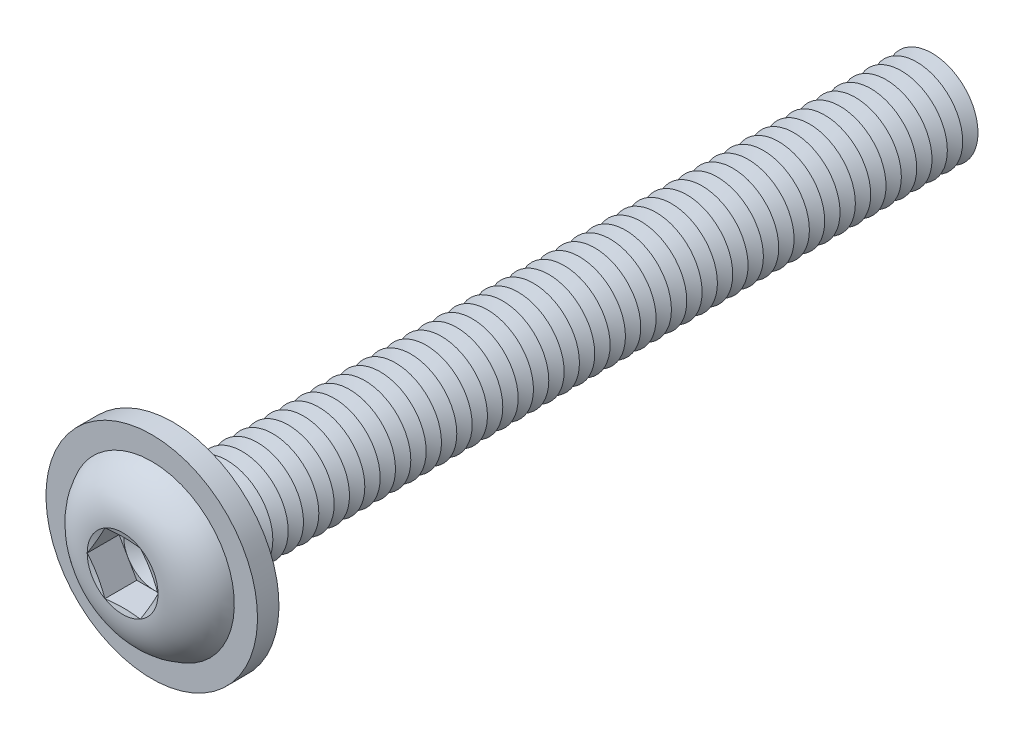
ISO-10303-21;
HEADER;
FILE_DESCRIPTION(('STEP AP214'),'2;1');
FILE_NAME('part.step','',(''),(''),'','','');
FILE_SCHEMA(('AUTOMOTIVE_DESIGN { 1 0 10303 214 1 1 1 1 }'));
ENDSEC;
DATA;
#1=APPLICATION_CONTEXT('core data for automotive mechanical design processes');
#2=APPLICATION_PROTOCOL_DEFINITION('international standard','automotive_design',2000,#1);
#3=PRODUCT_CONTEXT('',#1,'mechanical');
#4=PRODUCT('Part','Part','',(#3));
#5=PRODUCT_RELATED_PRODUCT_CATEGORY('part','',(#4));
#6=PRODUCT_DEFINITION_FORMATION('','',#4);
#7=PRODUCT_DEFINITION_CONTEXT('part definition',#1,'design');
#8=PRODUCT_DEFINITION('design','',#6,#7);
#9=PRODUCT_DEFINITION_SHAPE('','',#8);
#10=(LENGTH_UNIT() NAMED_UNIT(*) SI_UNIT(.MILLI.,.METRE.));
#11=(NAMED_UNIT(*) PLANE_ANGLE_UNIT() SI_UNIT($,.RADIAN.));
#12=(NAMED_UNIT(*) SI_UNIT($,.STERADIAN.) SOLID_ANGLE_UNIT());
#13=UNCERTAINTY_MEASURE_WITH_UNIT(LENGTH_MEASURE(1.E-05),#10,'distance_accuracy_value','');
#14=(GEOMETRIC_REPRESENTATION_CONTEXT(3) GLOBAL_UNCERTAINTY_ASSIGNED_CONTEXT((#13)) GLOBAL_UNIT_ASSIGNED_CONTEXT((#10,
#11,#12)) REPRESENTATION_CONTEXT('',''));
#15=CARTESIAN_POINT('',(0.,0.,0.));
#16=DIRECTION('',(0.,0.,1.));
#17=DIRECTION('',(1.,0.,0.));
#18=AXIS2_PLACEMENT_3D('',#15,#16,#17);
#19=CARTESIAN_POINT('',(0.,0.,-23.25));
#20=DIRECTION('',(0.,0.,1.));
#21=DIRECTION('',(1.,0.,0.));
#22=AXIS2_PLACEMENT_3D('',#19,#20,#21);
#23=CONICAL_SURFACE('',#22,1.50000000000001,1.0471975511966);
#24=CARTESIAN_POINT('',(0.,0.,-23.5));
#25=DIRECTION('',(0.,0.,1.));
#26=DIRECTION('',(1.,0.,0.));
#27=AXIS2_PLACEMENT_3D('',#24,#25,#26);
#28=CIRCLE('',#27,1.06698729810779);
#29=CARTESIAN_POINT('',(1.06698729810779,0.,-23.5));
#30=VERTEX_POINT('',#29);
#31=EDGE_CURVE('E611',#30,#30,#28,.T.);
#32=ORIENTED_EDGE('',*,*,#31,.T.);
#33=EDGE_LOOP('',(#32));
#34=FACE_BOUND('',#33,.T.);
#35=CARTESIAN_POINT('',(0.,0.,-23.25));
#36=DIRECTION('',(0.,0.,1.));
#37=DIRECTION('',(1.,0.,0.));
#38=AXIS2_PLACEMENT_3D('',#35,#36,#37);
#39=CIRCLE('',#38,1.50000000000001);
#40=CARTESIAN_POINT('',(1.50000000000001,0.,-23.25));
#41=VERTEX_POINT('',#40);
#42=EDGE_CURVE('E607',#41,#41,#39,.T.);
#43=ORIENTED_EDGE('',*,*,#42,.F.);
#44=EDGE_LOOP('',(#43));
#45=FACE_BOUND('',#44,.T.);
#46=ADVANCED_FACE('F39',(#34,#45),#23,.T.);
#47=CARTESIAN_POINT('',(0.,0.,-23.5));
#48=DIRECTION('',(0.,0.,-1.));
#49=DIRECTION('',(-1.,0.,0.));
#50=AXIS2_PLACEMENT_3D('',#47,#48,#49);
#51=CONICAL_SURFACE('',#50,1.06698729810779,1.0471975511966);
#52=CARTESIAN_POINT('',(0.,0.,-23.75));
#53=DIRECTION('',(0.,0.,1.));
#54=DIRECTION('',(1.,0.,0.));
#55=AXIS2_PLACEMENT_3D('',#52,#53,#54);
#56=CIRCLE('',#55,1.50000000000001);
#57=CARTESIAN_POINT('',(1.50000000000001,0.,-23.75));
#58=VERTEX_POINT('',#57);
#59=EDGE_CURVE('E615',#58,#58,#56,.T.);
#60=ORIENTED_EDGE('',*,*,#59,.T.);
#61=EDGE_LOOP('',(#60));
#62=FACE_BOUND('',#61,.T.);
#63=ORIENTED_EDGE('',*,*,#31,.F.);
#64=EDGE_LOOP('',(#63));
#65=FACE_BOUND('',#64,.T.);
#66=ADVANCED_FACE('F727',(#62,#65),#51,.T.);
#67=CARTESIAN_POINT('',(0.,1.50000000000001,-25.));
#68=DIRECTION('',(0.,0.,-1.));
#69=DIRECTION('',(-1.,0.,0.));
#70=AXIS2_PLACEMENT_3D('',#67,#68,#69);
#71=PLANE('',#70);
#72=CARTESIAN_POINT('',(0.,0.,-25.));
#73=DIRECTION('',(0.,0.,1.));
#74=DIRECTION('',(1.,0.,0.));
#75=AXIS2_PLACEMENT_3D('',#72,#73,#74);
#76=CIRCLE('',#75,1.06698729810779);
#77=CARTESIAN_POINT('',(1.06698729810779,0.,-25.));
#78=VERTEX_POINT('',#77);
#79=EDGE_CURVE('E635',#78,#78,#76,.T.);
#80=ORIENTED_EDGE('',*,*,#79,.F.);
#81=EDGE_LOOP('',(#80));
#82=FACE_BOUND('',#81,.T.);
#83=ADVANCED_FACE('F733',(#82),#71,.T.);
#84=CARTESIAN_POINT('',(0.,0.,-24.75));
#85=DIRECTION('',(0.,0.,1.));
#86=DIRECTION('',(1.,0.,0.));
#87=AXIS2_PLACEMENT_3D('',#84,#85,#86);
#88=CONICAL_SURFACE('',#87,1.50000000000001,1.0471975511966);
#89=ORIENTED_EDGE('',*,*,#79,.T.);
#90=EDGE_LOOP('',(#89));
#91=FACE_BOUND('',#90,.T.);
#92=CARTESIAN_POINT('',(0.,0.,-24.75));
#93=DIRECTION('',(0.,0.,1.));
#94=DIRECTION('',(1.,0.,0.));
#95=AXIS2_PLACEMENT_3D('',#92,#93,#94);
#96=CIRCLE('',#95,1.50000000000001);
#97=CARTESIAN_POINT('',(1.50000000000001,0.,-24.75));
#98=VERTEX_POINT('',#97);
#99=EDGE_CURVE('E631',#98,#98,#96,.T.);
#100=ORIENTED_EDGE('',*,*,#99,.F.);
#101=EDGE_LOOP('',(#100));
#102=FACE_BOUND('',#101,.T.);
#103=ADVANCED_FACE('F752',(#91,#102),#88,.T.);
#104=CARTESIAN_POINT('',(0.,0.,-24.5));
#105=DIRECTION('',(0.,0.,-1.));
#106=DIRECTION('',(-1.,0.,0.));
#107=AXIS2_PLACEMENT_3D('',#104,#105,#106);
#108=CONICAL_SURFACE('',#107,1.06698729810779,1.0471975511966);
#109=ORIENTED_EDGE('',*,*,#99,.T.);
#110=EDGE_LOOP('',(#109));
#111=FACE_BOUND('',#110,.T.);
#112=CARTESIAN_POINT('',(0.,0.,-24.5));
#113=DIRECTION('',(0.,0.,1.));
#114=DIRECTION('',(1.,0.,0.));
#115=AXIS2_PLACEMENT_3D('',#112,#113,#114);
#116=CIRCLE('',#115,1.06698729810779);
#117=CARTESIAN_POINT('',(1.06698729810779,0.,-24.5));
#118=VERTEX_POINT('',#117);
#119=EDGE_CURVE('E627',#118,#118,#116,.T.);
#120=ORIENTED_EDGE('',*,*,#119,.F.);
#121=EDGE_LOOP('',(#120));
#122=FACE_BOUND('',#121,.T.);
#123=ADVANCED_FACE('F749',(#111,#122),#108,.T.);
#124=CARTESIAN_POINT('',(0.,0.,-24.25));
#125=DIRECTION('',(0.,0.,1.));
#126=DIRECTION('',(1.,0.,0.));
#127=AXIS2_PLACEMENT_3D('',#124,#125,#126);
#128=CONICAL_SURFACE('',#127,1.50000000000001,1.0471975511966);
#129=ORIENTED_EDGE('',*,*,#119,.T.);
#130=EDGE_LOOP('',(#129));
#131=FACE_BOUND('',#130,.T.);
#132=CARTESIAN_POINT('',(0.,0.,-24.25));
#133=DIRECTION('',(0.,0.,1.));
#134=DIRECTION('',(1.,0.,0.));
#135=AXIS2_PLACEMENT_3D('',#132,#133,#134);
#136=CIRCLE('',#135,1.50000000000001);
#137=CARTESIAN_POINT('',(1.50000000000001,0.,-24.25));
#138=VERTEX_POINT('',#137);
#139=EDGE_CURVE('E623',#138,#138,#136,.T.);
#140=ORIENTED_EDGE('',*,*,#139,.F.);
#141=EDGE_LOOP('',(#140));
#142=FACE_BOUND('',#141,.T.);
#143=ADVANCED_FACE('F743',(#131,#142),#128,.T.);
#144=CARTESIAN_POINT('',(0.,0.,-24.));
#145=DIRECTION('',(0.,0.,-1.));
#146=DIRECTION('',(-1.,0.,0.));
#147=AXIS2_PLACEMENT_3D('',#144,#145,#146);
#148=CONICAL_SURFACE('',#147,1.06698729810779,1.0471975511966);
#149=ORIENTED_EDGE('',*,*,#139,.T.);
#150=EDGE_LOOP('',(#149));
#151=FACE_BOUND('',#150,.T.);
#152=CARTESIAN_POINT('',(0.,0.,-24.));
#153=DIRECTION('',(0.,0.,1.));
#154=DIRECTION('',(1.,0.,0.));
#155=AXIS2_PLACEMENT_3D('',#152,#153,#154);
#156=CIRCLE('',#155,1.06698729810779);
#157=CARTESIAN_POINT('',(1.06698729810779,0.,-24.));
#158=VERTEX_POINT('',#157);
#159=EDGE_CURVE('E619',#158,#158,#156,.T.);
#160=ORIENTED_EDGE('',*,*,#159,.F.);
#161=EDGE_LOOP('',(#160));
#162=FACE_BOUND('',#161,.T.);
#163=ADVANCED_FACE('F739',(#151,#162),#148,.T.);
#164=CARTESIAN_POINT('',(0.,0.,-23.75));
#165=DIRECTION('',(0.,0.,1.));
#166=DIRECTION('',(1.,0.,0.));
#167=AXIS2_PLACEMENT_3D('',#164,#165,#166);
#168=CONICAL_SURFACE('',#167,1.50000000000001,1.0471975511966);
#169=ORIENTED_EDGE('',*,*,#159,.T.);
#170=EDGE_LOOP('',(#169));
#171=FACE_BOUND('',#170,.T.);
#172=ORIENTED_EDGE('',*,*,#59,.F.);
#173=EDGE_LOOP('',(#172));
#174=FACE_BOUND('',#173,.T.);
#175=ADVANCED_FACE('F742',(#171,#174),#168,.T.);
#176=CARTESIAN_POINT('',(0.,0.,-22.75));
#177=DIRECTION('',(0.,0.,1.));
#178=DIRECTION('',(1.,0.,0.));
#179=AXIS2_PLACEMENT_3D('',#176,#177,#178);
#180=CONICAL_SURFACE('',#179,1.50000000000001,1.0471975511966);
#181=CARTESIAN_POINT('',(0.,0.,-23.));
#182=DIRECTION('',(0.,0.,1.));
#183=DIRECTION('',(1.,0.,0.));
#184=AXIS2_PLACEMENT_3D('',#181,#182,#183);
#185=CIRCLE('',#184,1.06698729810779);
#186=CARTESIAN_POINT('',(1.06698729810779,0.,-23.));
#187=VERTEX_POINT('',#186);
#188=EDGE_CURVE('E603',#187,#187,#185,.T.);
#189=ORIENTED_EDGE('',*,*,#188,.T.);
#190=EDGE_LOOP('',(#189));
#191=FACE_BOUND('',#190,.T.);
#192=CARTESIAN_POINT('',(0.,0.,-22.75));
#193=DIRECTION('',(0.,0.,1.));
#194=DIRECTION('',(1.,0.,0.));
#195=AXIS2_PLACEMENT_3D('',#192,#193,#194);
#196=CIRCLE('',#195,1.50000000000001);
#197=CARTESIAN_POINT('',(1.50000000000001,0.,-22.75));
#198=VERTEX_POINT('',#197);
#199=EDGE_CURVE('E599',#198,#198,#196,.T.);
#200=ORIENTED_EDGE('',*,*,#199,.F.);
#201=EDGE_LOOP('',(#200));
#202=FACE_BOUND('',#201,.T.);
#203=ADVANCED_FACE('F747',(#191,#202),#180,.T.);
#204=CARTESIAN_POINT('',(0.,0.,-23.));
#205=DIRECTION('',(0.,0.,-1.));
#206=DIRECTION('',(-1.,0.,0.));
#207=AXIS2_PLACEMENT_3D('',#204,#205,#206);
#208=CONICAL_SURFACE('',#207,1.06698729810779,1.0471975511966);
#209=ORIENTED_EDGE('',*,*,#42,.T.);
#210=EDGE_LOOP('',(#209));
#211=FACE_BOUND('',#210,.T.);
#212=ORIENTED_EDGE('',*,*,#188,.F.);
#213=EDGE_LOOP('',(#212));
#214=FACE_BOUND('',#213,.T.);
#215=ADVANCED_FACE('F798',(#211,#214),#208,.T.);
#216=CARTESIAN_POINT('',(0.,0.,-22.25));
#217=DIRECTION('',(0.,0.,1.));
#218=DIRECTION('',(1.,0.,0.));
#219=AXIS2_PLACEMENT_3D('',#216,#217,#218);
#220=CONICAL_SURFACE('',#219,1.50000000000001,1.0471975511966);
#221=CARTESIAN_POINT('',(0.,0.,-22.5));
#222=DIRECTION('',(0.,0.,1.));
#223=DIRECTION('',(1.,0.,0.));
#224=AXIS2_PLACEMENT_3D('',#221,#222,#223);
#225=CIRCLE('',#224,1.06698729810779);
#226=CARTESIAN_POINT('',(1.06698729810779,0.,-22.5));
#227=VERTEX_POINT('',#226);
#228=EDGE_CURVE('E595',#227,#227,#225,.T.);
#229=ORIENTED_EDGE('',*,*,#228,.T.);
#230=EDGE_LOOP('',(#229));
#231=FACE_BOUND('',#230,.T.);
#232=CARTESIAN_POINT('',(0.,0.,-22.25));
#233=DIRECTION('',(0.,0.,1.));
#234=DIRECTION('',(1.,0.,0.));
#235=AXIS2_PLACEMENT_3D('',#232,#233,#234);
#236=CIRCLE('',#235,1.50000000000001);
#237=CARTESIAN_POINT('',(1.50000000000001,0.,-22.25));
#238=VERTEX_POINT('',#237);
#239=EDGE_CURVE('E591',#238,#238,#236,.T.);
#240=ORIENTED_EDGE('',*,*,#239,.F.);
#241=EDGE_LOOP('',(#240));
#242=FACE_BOUND('',#241,.T.);
#243=ADVANCED_FACE('F804',(#231,#242),#220,.T.);
#244=CARTESIAN_POINT('',(0.,0.,-22.5));
#245=DIRECTION('',(0.,0.,-1.));
#246=DIRECTION('',(-1.,0.,0.));
#247=AXIS2_PLACEMENT_3D('',#244,#245,#246);
#248=CONICAL_SURFACE('',#247,1.06698729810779,1.0471975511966);
#249=ORIENTED_EDGE('',*,*,#199,.T.);
#250=EDGE_LOOP('',(#249));
#251=FACE_BOUND('',#250,.T.);
#252=ORIENTED_EDGE('',*,*,#228,.F.);
#253=EDGE_LOOP('',(#252));
#254=FACE_BOUND('',#253,.T.);
#255=ADVANCED_FACE('F811',(#251,#254),#248,.T.);
#256=CARTESIAN_POINT('',(0.,0.,-21.75));
#257=DIRECTION('',(0.,0.,1.));
#258=DIRECTION('',(1.,0.,0.));
#259=AXIS2_PLACEMENT_3D('',#256,#257,#258);
#260=CONICAL_SURFACE('',#259,1.50000000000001,1.0471975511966);
#261=CARTESIAN_POINT('',(0.,0.,-22.));
#262=DIRECTION('',(0.,0.,1.));
#263=DIRECTION('',(1.,0.,0.));
#264=AXIS2_PLACEMENT_3D('',#261,#262,#263);
#265=CIRCLE('',#264,1.06698729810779);
#266=CARTESIAN_POINT('',(1.06698729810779,0.,-22.));
#267=VERTEX_POINT('',#266);
#268=EDGE_CURVE('E587',#267,#267,#265,.T.);
#269=ORIENTED_EDGE('',*,*,#268,.T.);
#270=EDGE_LOOP('',(#269));
#271=FACE_BOUND('',#270,.T.);
#272=CARTESIAN_POINT('',(0.,0.,-21.75));
#273=DIRECTION('',(0.,0.,1.));
#274=DIRECTION('',(1.,0.,0.));
#275=AXIS2_PLACEMENT_3D('',#272,#273,#274);
#276=CIRCLE('',#275,1.50000000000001);
#277=CARTESIAN_POINT('',(1.50000000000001,0.,-21.75));
#278=VERTEX_POINT('',#277);
#279=EDGE_CURVE('E583',#278,#278,#276,.T.);
#280=ORIENTED_EDGE('',*,*,#279,.F.);
#281=EDGE_LOOP('',(#280));
#282=FACE_BOUND('',#281,.T.);
#283=ADVANCED_FACE('F818',(#271,#282),#260,.T.);
#284=CARTESIAN_POINT('',(0.,0.,-22.));
#285=DIRECTION('',(0.,0.,-1.));
#286=DIRECTION('',(-1.,0.,0.));
#287=AXIS2_PLACEMENT_3D('',#284,#285,#286);
#288=CONICAL_SURFACE('',#287,1.06698729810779,1.0471975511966);
#289=ORIENTED_EDGE('',*,*,#239,.T.);
#290=EDGE_LOOP('',(#289));
#291=FACE_BOUND('',#290,.T.);
#292=ORIENTED_EDGE('',*,*,#268,.F.);
#293=EDGE_LOOP('',(#292));
#294=FACE_BOUND('',#293,.T.);
#295=ADVANCED_FACE('F825',(#291,#294),#288,.T.);
#296=CARTESIAN_POINT('',(0.,0.,-21.25));
#297=DIRECTION('',(0.,0.,1.));
#298=DIRECTION('',(1.,0.,0.));
#299=AXIS2_PLACEMENT_3D('',#296,#297,#298);
#300=CONICAL_SURFACE('',#299,1.50000000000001,1.0471975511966);
#301=CARTESIAN_POINT('',(0.,0.,-21.5));
#302=DIRECTION('',(0.,0.,1.));
#303=DIRECTION('',(1.,0.,0.));
#304=AXIS2_PLACEMENT_3D('',#301,#302,#303);
#305=CIRCLE('',#304,1.06698729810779);
#306=CARTESIAN_POINT('',(1.06698729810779,0.,-21.5));
#307=VERTEX_POINT('',#306);
#308=EDGE_CURVE('E579',#307,#307,#305,.T.);
#309=ORIENTED_EDGE('',*,*,#308,.T.);
#310=EDGE_LOOP('',(#309));
#311=FACE_BOUND('',#310,.T.);
#312=CARTESIAN_POINT('',(0.,0.,-21.25));
#313=DIRECTION('',(0.,0.,1.));
#314=DIRECTION('',(1.,0.,0.));
#315=AXIS2_PLACEMENT_3D('',#312,#313,#314);
#316=CIRCLE('',#315,1.50000000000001);
#317=CARTESIAN_POINT('',(1.50000000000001,0.,-21.25));
#318=VERTEX_POINT('',#317);
#319=EDGE_CURVE('E575',#318,#318,#316,.T.);
#320=ORIENTED_EDGE('',*,*,#319,.F.);
#321=EDGE_LOOP('',(#320));
#322=FACE_BOUND('',#321,.T.);
#323=ADVANCED_FACE('F832',(#311,#322),#300,.T.);
#324=CARTESIAN_POINT('',(0.,0.,-21.5));
#325=DIRECTION('',(0.,0.,-1.));
#326=DIRECTION('',(-1.,0.,0.));
#327=AXIS2_PLACEMENT_3D('',#324,#325,#326);
#328=CONICAL_SURFACE('',#327,1.06698729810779,1.0471975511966);
#329=ORIENTED_EDGE('',*,*,#279,.T.);
#330=EDGE_LOOP('',(#329));
#331=FACE_BOUND('',#330,.T.);
#332=ORIENTED_EDGE('',*,*,#308,.F.);
#333=EDGE_LOOP('',(#332));
#334=FACE_BOUND('',#333,.T.);
#335=ADVANCED_FACE('F839',(#331,#334),#328,.T.);
#336=CARTESIAN_POINT('',(0.,0.,-20.75));
#337=DIRECTION('',(0.,0.,1.));
#338=DIRECTION('',(1.,0.,0.));
#339=AXIS2_PLACEMENT_3D('',#336,#337,#338);
#340=CONICAL_SURFACE('',#339,1.50000000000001,1.0471975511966);
#341=CARTESIAN_POINT('',(0.,0.,-21.));
#342=DIRECTION('',(0.,0.,1.));
#343=DIRECTION('',(1.,0.,0.));
#344=AXIS2_PLACEMENT_3D('',#341,#342,#343);
#345=CIRCLE('',#344,1.06698729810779);
#346=CARTESIAN_POINT('',(1.06698729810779,0.,-21.));
#347=VERTEX_POINT('',#346);
#348=EDGE_CURVE('E571',#347,#347,#345,.T.);
#349=ORIENTED_EDGE('',*,*,#348,.T.);
#350=EDGE_LOOP('',(#349));
#351=FACE_BOUND('',#350,.T.);
#352=CARTESIAN_POINT('',(0.,0.,-20.75));
#353=DIRECTION('',(0.,0.,1.));
#354=DIRECTION('',(1.,0.,0.));
#355=AXIS2_PLACEMENT_3D('',#352,#353,#354);
#356=CIRCLE('',#355,1.50000000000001);
#357=CARTESIAN_POINT('',(1.50000000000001,0.,-20.75));
#358=VERTEX_POINT('',#357);
#359=EDGE_CURVE('E567',#358,#358,#356,.T.);
#360=ORIENTED_EDGE('',*,*,#359,.F.);
#361=EDGE_LOOP('',(#360));
#362=FACE_BOUND('',#361,.T.);
#363=ADVANCED_FACE('F846',(#351,#362),#340,.T.);
#364=CARTESIAN_POINT('',(0.,0.,-21.));
#365=DIRECTION('',(0.,0.,-1.));
#366=DIRECTION('',(-1.,0.,0.));
#367=AXIS2_PLACEMENT_3D('',#364,#365,#366);
#368=CONICAL_SURFACE('',#367,1.06698729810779,1.0471975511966);
#369=ORIENTED_EDGE('',*,*,#319,.T.);
#370=EDGE_LOOP('',(#369));
#371=FACE_BOUND('',#370,.T.);
#372=ORIENTED_EDGE('',*,*,#348,.F.);
#373=EDGE_LOOP('',(#372));
#374=FACE_BOUND('',#373,.T.);
#375=ADVANCED_FACE('F853',(#371,#374),#368,.T.);
#376=CARTESIAN_POINT('',(0.,0.,-20.25));
#377=DIRECTION('',(0.,0.,1.));
#378=DIRECTION('',(1.,0.,0.));
#379=AXIS2_PLACEMENT_3D('',#376,#377,#378);
#380=CONICAL_SURFACE('',#379,1.50000000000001,1.0471975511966);
#381=CARTESIAN_POINT('',(0.,0.,-20.5));
#382=DIRECTION('',(0.,0.,1.));
#383=DIRECTION('',(1.,0.,0.));
#384=AXIS2_PLACEMENT_3D('',#381,#382,#383);
#385=CIRCLE('',#384,1.06698729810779);
#386=CARTESIAN_POINT('',(1.06698729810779,0.,-20.5));
#387=VERTEX_POINT('',#386);
#388=EDGE_CURVE('E563',#387,#387,#385,.T.);
#389=ORIENTED_EDGE('',*,*,#388,.T.);
#390=EDGE_LOOP('',(#389));
#391=FACE_BOUND('',#390,.T.);
#392=CARTESIAN_POINT('',(0.,0.,-20.25));
#393=DIRECTION('',(0.,0.,1.));
#394=DIRECTION('',(1.,0.,0.));
#395=AXIS2_PLACEMENT_3D('',#392,#393,#394);
#396=CIRCLE('',#395,1.50000000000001);
#397=CARTESIAN_POINT('',(1.50000000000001,0.,-20.25));
#398=VERTEX_POINT('',#397);
#399=EDGE_CURVE('E559',#398,#398,#396,.T.);
#400=ORIENTED_EDGE('',*,*,#399,.F.);
#401=EDGE_LOOP('',(#400));
#402=FACE_BOUND('',#401,.T.);
#403=ADVANCED_FACE('F860',(#391,#402),#380,.T.);
#404=CARTESIAN_POINT('',(0.,0.,-20.5));
#405=DIRECTION('',(0.,0.,-1.));
#406=DIRECTION('',(-1.,0.,0.));
#407=AXIS2_PLACEMENT_3D('',#404,#405,#406);
#408=CONICAL_SURFACE('',#407,1.06698729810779,1.0471975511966);
#409=ORIENTED_EDGE('',*,*,#359,.T.);
#410=EDGE_LOOP('',(#409));
#411=FACE_BOUND('',#410,.T.);
#412=ORIENTED_EDGE('',*,*,#388,.F.);
#413=EDGE_LOOP('',(#412));
#414=FACE_BOUND('',#413,.T.);
#415=ADVANCED_FACE('F867',(#411,#414),#408,.T.);
#416=CARTESIAN_POINT('',(0.,0.,-19.75));
#417=DIRECTION('',(0.,0.,1.));
#418=DIRECTION('',(1.,0.,0.));
#419=AXIS2_PLACEMENT_3D('',#416,#417,#418);
#420=CONICAL_SURFACE('',#419,1.50000000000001,1.0471975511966);
#421=CARTESIAN_POINT('',(0.,0.,-20.));
#422=DIRECTION('',(0.,0.,1.));
#423=DIRECTION('',(1.,0.,0.));
#424=AXIS2_PLACEMENT_3D('',#421,#422,#423);
#425=CIRCLE('',#424,1.06698729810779);
#426=CARTESIAN_POINT('',(1.06698729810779,0.,-20.));
#427=VERTEX_POINT('',#426);
#428=EDGE_CURVE('E555',#427,#427,#425,.T.);
#429=ORIENTED_EDGE('',*,*,#428,.T.);
#430=EDGE_LOOP('',(#429));
#431=FACE_BOUND('',#430,.T.);
#432=CARTESIAN_POINT('',(0.,0.,-19.75));
#433=DIRECTION('',(0.,0.,1.));
#434=DIRECTION('',(1.,0.,0.));
#435=AXIS2_PLACEMENT_3D('',#432,#433,#434);
#436=CIRCLE('',#435,1.50000000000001);
#437=CARTESIAN_POINT('',(1.50000000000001,0.,-19.75));
#438=VERTEX_POINT('',#437);
#439=EDGE_CURVE('E551',#438,#438,#436,.T.);
#440=ORIENTED_EDGE('',*,*,#439,.F.);
#441=EDGE_LOOP('',(#440));
#442=FACE_BOUND('',#441,.T.);
#443=ADVANCED_FACE('F874',(#431,#442),#420,.T.);
#444=CARTESIAN_POINT('',(0.,0.,-20.));
#445=DIRECTION('',(0.,0.,-1.));
#446=DIRECTION('',(-1.,0.,0.));
#447=AXIS2_PLACEMENT_3D('',#444,#445,#446);
#448=CONICAL_SURFACE('',#447,1.06698729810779,1.0471975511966);
#449=ORIENTED_EDGE('',*,*,#399,.T.);
#450=EDGE_LOOP('',(#449));
#451=FACE_BOUND('',#450,.T.);
#452=ORIENTED_EDGE('',*,*,#428,.F.);
#453=EDGE_LOOP('',(#452));
#454=FACE_BOUND('',#453,.T.);
#455=ADVANCED_FACE('F881',(#451,#454),#448,.T.);
#456=CARTESIAN_POINT('',(0.,0.,-19.25));
#457=DIRECTION('',(0.,0.,1.));
#458=DIRECTION('',(1.,0.,0.));
#459=AXIS2_PLACEMENT_3D('',#456,#457,#458);
#460=CONICAL_SURFACE('',#459,1.50000000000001,1.0471975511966);
#461=CARTESIAN_POINT('',(0.,0.,-19.5));
#462=DIRECTION('',(0.,0.,1.));
#463=DIRECTION('',(1.,0.,0.));
#464=AXIS2_PLACEMENT_3D('',#461,#462,#463);
#465=CIRCLE('',#464,1.06698729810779);
#466=CARTESIAN_POINT('',(1.06698729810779,0.,-19.5));
#467=VERTEX_POINT('',#466);
#468=EDGE_CURVE('E547',#467,#467,#465,.T.);
#469=ORIENTED_EDGE('',*,*,#468,.T.);
#470=EDGE_LOOP('',(#469));
#471=FACE_BOUND('',#470,.T.);
#472=CARTESIAN_POINT('',(0.,0.,-19.25));
#473=DIRECTION('',(0.,0.,1.));
#474=DIRECTION('',(1.,0.,0.));
#475=AXIS2_PLACEMENT_3D('',#472,#473,#474);
#476=CIRCLE('',#475,1.50000000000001);
#477=CARTESIAN_POINT('',(1.50000000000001,0.,-19.25));
#478=VERTEX_POINT('',#477);
#479=EDGE_CURVE('E543',#478,#478,#476,.T.);
#480=ORIENTED_EDGE('',*,*,#479,.F.);
#481=EDGE_LOOP('',(#480));
#482=FACE_BOUND('',#481,.T.);
#483=ADVANCED_FACE('F888',(#471,#482),#460,.T.);
#484=CARTESIAN_POINT('',(0.,0.,-19.5));
#485=DIRECTION('',(0.,0.,-1.));
#486=DIRECTION('',(-1.,0.,0.));
#487=AXIS2_PLACEMENT_3D('',#484,#485,#486);
#488=CONICAL_SURFACE('',#487,1.06698729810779,1.0471975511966);
#489=ORIENTED_EDGE('',*,*,#439,.T.);
#490=EDGE_LOOP('',(#489));
#491=FACE_BOUND('',#490,.T.);
#492=ORIENTED_EDGE('',*,*,#468,.F.);
#493=EDGE_LOOP('',(#492));
#494=FACE_BOUND('',#493,.T.);
#495=ADVANCED_FACE('F895',(#491,#494),#488,.T.);
#496=CARTESIAN_POINT('',(0.,0.,-18.75));
#497=DIRECTION('',(0.,0.,1.));
#498=DIRECTION('',(1.,0.,0.));
#499=AXIS2_PLACEMENT_3D('',#496,#497,#498);
#500=CONICAL_SURFACE('',#499,1.50000000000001,1.0471975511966);
#501=CARTESIAN_POINT('',(0.,0.,-19.));
#502=DIRECTION('',(0.,0.,1.));
#503=DIRECTION('',(1.,0.,0.));
#504=AXIS2_PLACEMENT_3D('',#501,#502,#503);
#505=CIRCLE('',#504,1.06698729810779);
#506=CARTESIAN_POINT('',(1.06698729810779,0.,-19.));
#507=VERTEX_POINT('',#506);
#508=EDGE_CURVE('E539',#507,#507,#505,.T.);
#509=ORIENTED_EDGE('',*,*,#508,.T.);
#510=EDGE_LOOP('',(#509));
#511=FACE_BOUND('',#510,.T.);
#512=CARTESIAN_POINT('',(0.,0.,-18.75));
#513=DIRECTION('',(0.,0.,1.));
#514=DIRECTION('',(1.,0.,0.));
#515=AXIS2_PLACEMENT_3D('',#512,#513,#514);
#516=CIRCLE('',#515,1.50000000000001);
#517=CARTESIAN_POINT('',(1.50000000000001,0.,-18.75));
#518=VERTEX_POINT('',#517);
#519=EDGE_CURVE('E535',#518,#518,#516,.T.);
#520=ORIENTED_EDGE('',*,*,#519,.F.);
#521=EDGE_LOOP('',(#520));
#522=FACE_BOUND('',#521,.T.);
#523=ADVANCED_FACE('F902',(#511,#522),#500,.T.);
#524=CARTESIAN_POINT('',(0.,0.,-19.));
#525=DIRECTION('',(0.,0.,-1.));
#526=DIRECTION('',(-1.,0.,0.));
#527=AXIS2_PLACEMENT_3D('',#524,#525,#526);
#528=CONICAL_SURFACE('',#527,1.06698729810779,1.0471975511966);
#529=ORIENTED_EDGE('',*,*,#479,.T.);
#530=EDGE_LOOP('',(#529));
#531=FACE_BOUND('',#530,.T.);
#532=ORIENTED_EDGE('',*,*,#508,.F.);
#533=EDGE_LOOP('',(#532));
#534=FACE_BOUND('',#533,.T.);
#535=ADVANCED_FACE('F909',(#531,#534),#528,.T.);
#536=CARTESIAN_POINT('',(0.,0.,-18.25));
#537=DIRECTION('',(0.,0.,1.));
#538=DIRECTION('',(1.,0.,0.));
#539=AXIS2_PLACEMENT_3D('',#536,#537,#538);
#540=CONICAL_SURFACE('',#539,1.50000000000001,1.0471975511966);
#541=CARTESIAN_POINT('',(0.,0.,-18.5));
#542=DIRECTION('',(0.,0.,1.));
#543=DIRECTION('',(1.,0.,0.));
#544=AXIS2_PLACEMENT_3D('',#541,#542,#543);
#545=CIRCLE('',#544,1.06698729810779);
#546=CARTESIAN_POINT('',(1.06698729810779,0.,-18.5));
#547=VERTEX_POINT('',#546);
#548=EDGE_CURVE('E531',#547,#547,#545,.T.);
#549=ORIENTED_EDGE('',*,*,#548,.T.);
#550=EDGE_LOOP('',(#549));
#551=FACE_BOUND('',#550,.T.);
#552=CARTESIAN_POINT('',(0.,0.,-18.25));
#553=DIRECTION('',(0.,0.,1.));
#554=DIRECTION('',(1.,0.,0.));
#555=AXIS2_PLACEMENT_3D('',#552,#553,#554);
#556=CIRCLE('',#555,1.50000000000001);
#557=CARTESIAN_POINT('',(1.50000000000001,0.,-18.25));
#558=VERTEX_POINT('',#557);
#559=EDGE_CURVE('E527',#558,#558,#556,.T.);
#560=ORIENTED_EDGE('',*,*,#559,.F.);
#561=EDGE_LOOP('',(#560));
#562=FACE_BOUND('',#561,.T.);
#563=ADVANCED_FACE('F916',(#551,#562),#540,.T.);
#564=CARTESIAN_POINT('',(0.,0.,-18.5));
#565=DIRECTION('',(0.,0.,-1.));
#566=DIRECTION('',(-1.,0.,0.));
#567=AXIS2_PLACEMENT_3D('',#564,#565,#566);
#568=CONICAL_SURFACE('',#567,1.06698729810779,1.0471975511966);
#569=ORIENTED_EDGE('',*,*,#519,.T.);
#570=EDGE_LOOP('',(#569));
#571=FACE_BOUND('',#570,.T.);
#572=ORIENTED_EDGE('',*,*,#548,.F.);
#573=EDGE_LOOP('',(#572));
#574=FACE_BOUND('',#573,.T.);
#575=ADVANCED_FACE('F923',(#571,#574),#568,.T.);
#576=CARTESIAN_POINT('',(0.,0.,-17.75));
#577=DIRECTION('',(0.,0.,1.));
#578=DIRECTION('',(1.,0.,0.));
#579=AXIS2_PLACEMENT_3D('',#576,#577,#578);
#580=CONICAL_SURFACE('',#579,1.50000000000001,1.0471975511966);
#581=CARTESIAN_POINT('',(0.,0.,-18.));
#582=DIRECTION('',(0.,0.,1.));
#583=DIRECTION('',(1.,0.,0.));
#584=AXIS2_PLACEMENT_3D('',#581,#582,#583);
#585=CIRCLE('',#584,1.06698729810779);
#586=CARTESIAN_POINT('',(1.06698729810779,0.,-18.));
#587=VERTEX_POINT('',#586);
#588=EDGE_CURVE('E523',#587,#587,#585,.T.);
#589=ORIENTED_EDGE('',*,*,#588,.T.);
#590=EDGE_LOOP('',(#589));
#591=FACE_BOUND('',#590,.T.);
#592=CARTESIAN_POINT('',(0.,0.,-17.75));
#593=DIRECTION('',(0.,0.,1.));
#594=DIRECTION('',(1.,0.,0.));
#595=AXIS2_PLACEMENT_3D('',#592,#593,#594);
#596=CIRCLE('',#595,1.50000000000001);
#597=CARTESIAN_POINT('',(1.50000000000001,0.,-17.75));
#598=VERTEX_POINT('',#597);
#599=EDGE_CURVE('E519',#598,#598,#596,.T.);
#600=ORIENTED_EDGE('',*,*,#599,.F.);
#601=EDGE_LOOP('',(#600));
#602=FACE_BOUND('',#601,.T.);
#603=ADVANCED_FACE('F930',(#591,#602),#580,.T.);
#604=CARTESIAN_POINT('',(0.,0.,-18.));
#605=DIRECTION('',(0.,0.,-1.));
#606=DIRECTION('',(-1.,0.,0.));
#607=AXIS2_PLACEMENT_3D('',#604,#605,#606);
#608=CONICAL_SURFACE('',#607,1.06698729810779,1.0471975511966);
#609=ORIENTED_EDGE('',*,*,#559,.T.);
#610=EDGE_LOOP('',(#609));
#611=FACE_BOUND('',#610,.T.);
#612=ORIENTED_EDGE('',*,*,#588,.F.);
#613=EDGE_LOOP('',(#612));
#614=FACE_BOUND('',#613,.T.);
#615=ADVANCED_FACE('F937',(#611,#614),#608,.T.);
#616=CARTESIAN_POINT('',(0.,0.,-17.25));
#617=DIRECTION('',(0.,0.,1.));
#618=DIRECTION('',(1.,0.,0.));
#619=AXIS2_PLACEMENT_3D('',#616,#617,#618);
#620=CONICAL_SURFACE('',#619,1.50000000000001,1.0471975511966);
#621=CARTESIAN_POINT('',(0.,0.,-17.5));
#622=DIRECTION('',(0.,0.,1.));
#623=DIRECTION('',(1.,0.,0.));
#624=AXIS2_PLACEMENT_3D('',#621,#622,#623);
#625=CIRCLE('',#624,1.06698729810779);
#626=CARTESIAN_POINT('',(1.06698729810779,0.,-17.5));
#627=VERTEX_POINT('',#626);
#628=EDGE_CURVE('E515',#627,#627,#625,.T.);
#629=ORIENTED_EDGE('',*,*,#628,.T.);
#630=EDGE_LOOP('',(#629));
#631=FACE_BOUND('',#630,.T.);
#632=CARTESIAN_POINT('',(0.,0.,-17.25));
#633=DIRECTION('',(0.,0.,1.));
#634=DIRECTION('',(1.,0.,0.));
#635=AXIS2_PLACEMENT_3D('',#632,#633,#634);
#636=CIRCLE('',#635,1.50000000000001);
#637=CARTESIAN_POINT('',(1.50000000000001,0.,-17.25));
#638=VERTEX_POINT('',#637);
#639=EDGE_CURVE('E511',#638,#638,#636,.T.);
#640=ORIENTED_EDGE('',*,*,#639,.F.);
#641=EDGE_LOOP('',(#640));
#642=FACE_BOUND('',#641,.T.);
#643=ADVANCED_FACE('F944',(#631,#642),#620,.T.);
#644=CARTESIAN_POINT('',(0.,0.,-17.5));
#645=DIRECTION('',(0.,0.,-1.));
#646=DIRECTION('',(-1.,0.,0.));
#647=AXIS2_PLACEMENT_3D('',#644,#645,#646);
#648=CONICAL_SURFACE('',#647,1.06698729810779,1.0471975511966);
#649=ORIENTED_EDGE('',*,*,#599,.T.);
#650=EDGE_LOOP('',(#649));
#651=FACE_BOUND('',#650,.T.);
#652=ORIENTED_EDGE('',*,*,#628,.F.);
#653=EDGE_LOOP('',(#652));
#654=FACE_BOUND('',#653,.T.);
#655=ADVANCED_FACE('F951',(#651,#654),#648,.T.);
#656=CARTESIAN_POINT('',(0.,0.,-16.75));
#657=DIRECTION('',(0.,0.,1.));
#658=DIRECTION('',(1.,0.,0.));
#659=AXIS2_PLACEMENT_3D('',#656,#657,#658);
#660=CONICAL_SURFACE('',#659,1.50000000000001,1.0471975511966);
#661=CARTESIAN_POINT('',(0.,0.,-17.));
#662=DIRECTION('',(0.,0.,1.));
#663=DIRECTION('',(1.,0.,0.));
#664=AXIS2_PLACEMENT_3D('',#661,#662,#663);
#665=CIRCLE('',#664,1.06698729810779);
#666=CARTESIAN_POINT('',(1.06698729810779,0.,-17.));
#667=VERTEX_POINT('',#666);
#668=EDGE_CURVE('E507',#667,#667,#665,.T.);
#669=ORIENTED_EDGE('',*,*,#668,.T.);
#670=EDGE_LOOP('',(#669));
#671=FACE_BOUND('',#670,.T.);
#672=CARTESIAN_POINT('',(0.,0.,-16.75));
#673=DIRECTION('',(0.,0.,1.));
#674=DIRECTION('',(1.,0.,0.));
#675=AXIS2_PLACEMENT_3D('',#672,#673,#674);
#676=CIRCLE('',#675,1.50000000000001);
#677=CARTESIAN_POINT('',(1.50000000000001,0.,-16.75));
#678=VERTEX_POINT('',#677);
#679=EDGE_CURVE('E503',#678,#678,#676,.T.);
#680=ORIENTED_EDGE('',*,*,#679,.F.);
#681=EDGE_LOOP('',(#680));
#682=FACE_BOUND('',#681,.T.);
#683=ADVANCED_FACE('F958',(#671,#682),#660,.T.);
#684=CARTESIAN_POINT('',(0.,0.,-17.));
#685=DIRECTION('',(0.,0.,-1.));
#686=DIRECTION('',(-1.,0.,0.));
#687=AXIS2_PLACEMENT_3D('',#684,#685,#686);
#688=CONICAL_SURFACE('',#687,1.06698729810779,1.0471975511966);
#689=ORIENTED_EDGE('',*,*,#639,.T.);
#690=EDGE_LOOP('',(#689));
#691=FACE_BOUND('',#690,.T.);
#692=ORIENTED_EDGE('',*,*,#668,.F.);
#693=EDGE_LOOP('',(#692));
#694=FACE_BOUND('',#693,.T.);
#695=ADVANCED_FACE('F965',(#691,#694),#688,.T.);
#696=CARTESIAN_POINT('',(0.,0.,-16.25));
#697=DIRECTION('',(0.,0.,1.));
#698=DIRECTION('',(1.,0.,0.));
#699=AXIS2_PLACEMENT_3D('',#696,#697,#698);
#700=CONICAL_SURFACE('',#699,1.50000000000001,1.0471975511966);
#701=CARTESIAN_POINT('',(0.,0.,-16.5));
#702=DIRECTION('',(0.,0.,1.));
#703=DIRECTION('',(1.,0.,0.));
#704=AXIS2_PLACEMENT_3D('',#701,#702,#703);
#705=CIRCLE('',#704,1.06698729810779);
#706=CARTESIAN_POINT('',(1.06698729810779,0.,-16.5));
#707=VERTEX_POINT('',#706);
#708=EDGE_CURVE('E499',#707,#707,#705,.T.);
#709=ORIENTED_EDGE('',*,*,#708,.T.);
#710=EDGE_LOOP('',(#709));
#711=FACE_BOUND('',#710,.T.);
#712=CARTESIAN_POINT('',(0.,0.,-16.25));
#713=DIRECTION('',(0.,0.,1.));
#714=DIRECTION('',(1.,0.,0.));
#715=AXIS2_PLACEMENT_3D('',#712,#713,#714);
#716=CIRCLE('',#715,1.50000000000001);
#717=CARTESIAN_POINT('',(1.50000000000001,0.,-16.25));
#718=VERTEX_POINT('',#717);
#719=EDGE_CURVE('E495',#718,#718,#716,.T.);
#720=ORIENTED_EDGE('',*,*,#719,.F.);
#721=EDGE_LOOP('',(#720));
#722=FACE_BOUND('',#721,.T.);
#723=ADVANCED_FACE('F972',(#711,#722),#700,.T.);
#724=CARTESIAN_POINT('',(0.,0.,-16.5));
#725=DIRECTION('',(0.,0.,-1.));
#726=DIRECTION('',(-1.,0.,0.));
#727=AXIS2_PLACEMENT_3D('',#724,#725,#726);
#728=CONICAL_SURFACE('',#727,1.06698729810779,1.0471975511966);
#729=ORIENTED_EDGE('',*,*,#679,.T.);
#730=EDGE_LOOP('',(#729));
#731=FACE_BOUND('',#730,.T.);
#732=ORIENTED_EDGE('',*,*,#708,.F.);
#733=EDGE_LOOP('',(#732));
#734=FACE_BOUND('',#733,.T.);
#735=ADVANCED_FACE('F979',(#731,#734),#728,.T.);
#736=CARTESIAN_POINT('',(0.,0.,-15.75));
#737=DIRECTION('',(0.,0.,1.));
#738=DIRECTION('',(1.,0.,0.));
#739=AXIS2_PLACEMENT_3D('',#736,#737,#738);
#740=CONICAL_SURFACE('',#739,1.50000000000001,1.0471975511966);
#741=CARTESIAN_POINT('',(0.,0.,-16.));
#742=DIRECTION('',(0.,0.,1.));
#743=DIRECTION('',(1.,0.,0.));
#744=AXIS2_PLACEMENT_3D('',#741,#742,#743);
#745=CIRCLE('',#744,1.06698729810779);
#746=CARTESIAN_POINT('',(1.06698729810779,0.,-16.));
#747=VERTEX_POINT('',#746);
#748=EDGE_CURVE('E491',#747,#747,#745,.T.);
#749=ORIENTED_EDGE('',*,*,#748,.T.);
#750=EDGE_LOOP('',(#749));
#751=FACE_BOUND('',#750,.T.);
#752=CARTESIAN_POINT('',(0.,0.,-15.75));
#753=DIRECTION('',(0.,0.,1.));
#754=DIRECTION('',(1.,0.,0.));
#755=AXIS2_PLACEMENT_3D('',#752,#753,#754);
#756=CIRCLE('',#755,1.50000000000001);
#757=CARTESIAN_POINT('',(1.50000000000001,0.,-15.75));
#758=VERTEX_POINT('',#757);
#759=EDGE_CURVE('E487',#758,#758,#756,.T.);
#760=ORIENTED_EDGE('',*,*,#759,.F.);
#761=EDGE_LOOP('',(#760));
#762=FACE_BOUND('',#761,.T.);
#763=ADVANCED_FACE('F986',(#751,#762),#740,.T.);
#764=CARTESIAN_POINT('',(0.,0.,-16.));
#765=DIRECTION('',(0.,0.,-1.));
#766=DIRECTION('',(-1.,0.,0.));
#767=AXIS2_PLACEMENT_3D('',#764,#765,#766);
#768=CONICAL_SURFACE('',#767,1.06698729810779,1.0471975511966);
#769=ORIENTED_EDGE('',*,*,#719,.T.);
#770=EDGE_LOOP('',(#769));
#771=FACE_BOUND('',#770,.T.);
#772=ORIENTED_EDGE('',*,*,#748,.F.);
#773=EDGE_LOOP('',(#772));
#774=FACE_BOUND('',#773,.T.);
#775=ADVANCED_FACE('F993',(#771,#774),#768,.T.);
#776=CARTESIAN_POINT('',(0.,0.,-15.25));
#777=DIRECTION('',(0.,0.,1.));
#778=DIRECTION('',(1.,0.,0.));
#779=AXIS2_PLACEMENT_3D('',#776,#777,#778);
#780=CONICAL_SURFACE('',#779,1.50000000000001,1.0471975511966);
#781=CARTESIAN_POINT('',(0.,0.,-15.5));
#782=DIRECTION('',(0.,0.,1.));
#783=DIRECTION('',(1.,0.,0.));
#784=AXIS2_PLACEMENT_3D('',#781,#782,#783);
#785=CIRCLE('',#784,1.06698729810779);
#786=CARTESIAN_POINT('',(1.06698729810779,0.,-15.5));
#787=VERTEX_POINT('',#786);
#788=EDGE_CURVE('E483',#787,#787,#785,.T.);
#789=ORIENTED_EDGE('',*,*,#788,.T.);
#790=EDGE_LOOP('',(#789));
#791=FACE_BOUND('',#790,.T.);
#792=CARTESIAN_POINT('',(0.,0.,-15.25));
#793=DIRECTION('',(0.,0.,1.));
#794=DIRECTION('',(1.,0.,0.));
#795=AXIS2_PLACEMENT_3D('',#792,#793,#794);
#796=CIRCLE('',#795,1.50000000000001);
#797=CARTESIAN_POINT('',(1.50000000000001,0.,-15.25));
#798=VERTEX_POINT('',#797);
#799=EDGE_CURVE('E479',#798,#798,#796,.T.);
#800=ORIENTED_EDGE('',*,*,#799,.F.);
#801=EDGE_LOOP('',(#800));
#802=FACE_BOUND('',#801,.T.);
#803=ADVANCED_FACE('F1000',(#791,#802),#780,.T.);
#804=CARTESIAN_POINT('',(0.,0.,-15.5));
#805=DIRECTION('',(0.,0.,-1.));
#806=DIRECTION('',(-1.,0.,0.));
#807=AXIS2_PLACEMENT_3D('',#804,#805,#806);
#808=CONICAL_SURFACE('',#807,1.06698729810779,1.0471975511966);
#809=ORIENTED_EDGE('',*,*,#759,.T.);
#810=EDGE_LOOP('',(#809));
#811=FACE_BOUND('',#810,.T.);
#812=ORIENTED_EDGE('',*,*,#788,.F.);
#813=EDGE_LOOP('',(#812));
#814=FACE_BOUND('',#813,.T.);
#815=ADVANCED_FACE('F1007',(#811,#814),#808,.T.);
#816=CARTESIAN_POINT('',(0.,0.,-14.75));
#817=DIRECTION('',(0.,0.,1.));
#818=DIRECTION('',(1.,0.,0.));
#819=AXIS2_PLACEMENT_3D('',#816,#817,#818);
#820=CONICAL_SURFACE('',#819,1.50000000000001,1.0471975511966);
#821=CARTESIAN_POINT('',(0.,0.,-15.));
#822=DIRECTION('',(0.,0.,1.));
#823=DIRECTION('',(1.,0.,0.));
#824=AXIS2_PLACEMENT_3D('',#821,#822,#823);
#825=CIRCLE('',#824,1.06698729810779);
#826=CARTESIAN_POINT('',(1.06698729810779,0.,-15.));
#827=VERTEX_POINT('',#826);
#828=EDGE_CURVE('E475',#827,#827,#825,.T.);
#829=ORIENTED_EDGE('',*,*,#828,.T.);
#830=EDGE_LOOP('',(#829));
#831=FACE_BOUND('',#830,.T.);
#832=CARTESIAN_POINT('',(0.,0.,-14.75));
#833=DIRECTION('',(0.,0.,1.));
#834=DIRECTION('',(1.,0.,0.));
#835=AXIS2_PLACEMENT_3D('',#832,#833,#834);
#836=CIRCLE('',#835,1.50000000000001);
#837=CARTESIAN_POINT('',(1.50000000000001,0.,-14.75));
#838=VERTEX_POINT('',#837);
#839=EDGE_CURVE('E471',#838,#838,#836,.T.);
#840=ORIENTED_EDGE('',*,*,#839,.F.);
#841=EDGE_LOOP('',(#840));
#842=FACE_BOUND('',#841,.T.);
#843=ADVANCED_FACE('F1014',(#831,#842),#820,.T.);
#844=CARTESIAN_POINT('',(0.,0.,-15.));
#845=DIRECTION('',(0.,0.,-1.));
#846=DIRECTION('',(-1.,0.,0.));
#847=AXIS2_PLACEMENT_3D('',#844,#845,#846);
#848=CONICAL_SURFACE('',#847,1.06698729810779,1.0471975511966);
#849=ORIENTED_EDGE('',*,*,#799,.T.);
#850=EDGE_LOOP('',(#849));
#851=FACE_BOUND('',#850,.T.);
#852=ORIENTED_EDGE('',*,*,#828,.F.);
#853=EDGE_LOOP('',(#852));
#854=FACE_BOUND('',#853,.T.);
#855=ADVANCED_FACE('F1021',(#851,#854),#848,.T.);
#856=CARTESIAN_POINT('',(0.,0.,-14.25));
#857=DIRECTION('',(0.,0.,1.));
#858=DIRECTION('',(1.,0.,0.));
#859=AXIS2_PLACEMENT_3D('',#856,#857,#858);
#860=CONICAL_SURFACE('',#859,1.50000000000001,1.0471975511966);
#861=CARTESIAN_POINT('',(0.,0.,-14.5));
#862=DIRECTION('',(0.,0.,1.));
#863=DIRECTION('',(1.,0.,0.));
#864=AXIS2_PLACEMENT_3D('',#861,#862,#863);
#865=CIRCLE('',#864,1.06698729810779);
#866=CARTESIAN_POINT('',(1.06698729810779,0.,-14.5));
#867=VERTEX_POINT('',#866);
#868=EDGE_CURVE('E467',#867,#867,#865,.T.);
#869=ORIENTED_EDGE('',*,*,#868,.T.);
#870=EDGE_LOOP('',(#869));
#871=FACE_BOUND('',#870,.T.);
#872=CARTESIAN_POINT('',(0.,0.,-14.25));
#873=DIRECTION('',(0.,0.,1.));
#874=DIRECTION('',(1.,0.,0.));
#875=AXIS2_PLACEMENT_3D('',#872,#873,#874);
#876=CIRCLE('',#875,1.50000000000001);
#877=CARTESIAN_POINT('',(1.50000000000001,0.,-14.25));
#878=VERTEX_POINT('',#877);
#879=EDGE_CURVE('E463',#878,#878,#876,.T.);
#880=ORIENTED_EDGE('',*,*,#879,.F.);
#881=EDGE_LOOP('',(#880));
#882=FACE_BOUND('',#881,.T.);
#883=ADVANCED_FACE('F1028',(#871,#882),#860,.T.);
#884=CARTESIAN_POINT('',(0.,0.,-14.5));
#885=DIRECTION('',(0.,0.,-1.));
#886=DIRECTION('',(-1.,0.,0.));
#887=AXIS2_PLACEMENT_3D('',#884,#885,#886);
#888=CONICAL_SURFACE('',#887,1.06698729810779,1.0471975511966);
#889=ORIENTED_EDGE('',*,*,#839,.T.);
#890=EDGE_LOOP('',(#889));
#891=FACE_BOUND('',#890,.T.);
#892=ORIENTED_EDGE('',*,*,#868,.F.);
#893=EDGE_LOOP('',(#892));
#894=FACE_BOUND('',#893,.T.);
#895=ADVANCED_FACE('F1035',(#891,#894),#888,.T.);
#896=CARTESIAN_POINT('',(0.,0.,-13.75));
#897=DIRECTION('',(0.,0.,1.));
#898=DIRECTION('',(1.,0.,0.));
#899=AXIS2_PLACEMENT_3D('',#896,#897,#898);
#900=CONICAL_SURFACE('',#899,1.50000000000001,1.0471975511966);
#901=CARTESIAN_POINT('',(0.,0.,-14.));
#902=DIRECTION('',(0.,0.,1.));
#903=DIRECTION('',(1.,0.,0.));
#904=AXIS2_PLACEMENT_3D('',#901,#902,#903);
#905=CIRCLE('',#904,1.06698729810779);
#906=CARTESIAN_POINT('',(1.06698729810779,0.,-14.));
#907=VERTEX_POINT('',#906);
#908=EDGE_CURVE('E459',#907,#907,#905,.T.);
#909=ORIENTED_EDGE('',*,*,#908,.T.);
#910=EDGE_LOOP('',(#909));
#911=FACE_BOUND('',#910,.T.);
#912=CARTESIAN_POINT('',(0.,0.,-13.75));
#913=DIRECTION('',(0.,0.,1.));
#914=DIRECTION('',(1.,0.,0.));
#915=AXIS2_PLACEMENT_3D('',#912,#913,#914);
#916=CIRCLE('',#915,1.50000000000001);
#917=CARTESIAN_POINT('',(1.50000000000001,0.,-13.75));
#918=VERTEX_POINT('',#917);
#919=EDGE_CURVE('E455',#918,#918,#916,.T.);
#920=ORIENTED_EDGE('',*,*,#919,.F.);
#921=EDGE_LOOP('',(#920));
#922=FACE_BOUND('',#921,.T.);
#923=ADVANCED_FACE('F1042',(#911,#922),#900,.T.);
#924=CARTESIAN_POINT('',(0.,0.,-14.));
#925=DIRECTION('',(0.,0.,-1.));
#926=DIRECTION('',(-1.,0.,0.));
#927=AXIS2_PLACEMENT_3D('',#924,#925,#926);
#928=CONICAL_SURFACE('',#927,1.06698729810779,1.0471975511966);
#929=ORIENTED_EDGE('',*,*,#879,.T.);
#930=EDGE_LOOP('',(#929));
#931=FACE_BOUND('',#930,.T.);
#932=ORIENTED_EDGE('',*,*,#908,.F.);
#933=EDGE_LOOP('',(#932));
#934=FACE_BOUND('',#933,.T.);
#935=ADVANCED_FACE('F1049',(#931,#934),#928,.T.);
#936=CARTESIAN_POINT('',(0.,0.,-13.25));
#937=DIRECTION('',(0.,0.,1.));
#938=DIRECTION('',(1.,0.,0.));
#939=AXIS2_PLACEMENT_3D('',#936,#937,#938);
#940=CONICAL_SURFACE('',#939,1.50000000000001,1.0471975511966);
#941=CARTESIAN_POINT('',(0.,0.,-13.5));
#942=DIRECTION('',(0.,0.,1.));
#943=DIRECTION('',(1.,0.,0.));
#944=AXIS2_PLACEMENT_3D('',#941,#942,#943);
#945=CIRCLE('',#944,1.06698729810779);
#946=CARTESIAN_POINT('',(1.06698729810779,0.,-13.5));
#947=VERTEX_POINT('',#946);
#948=EDGE_CURVE('E451',#947,#947,#945,.T.);
#949=ORIENTED_EDGE('',*,*,#948,.T.);
#950=EDGE_LOOP('',(#949));
#951=FACE_BOUND('',#950,.T.);
#952=CARTESIAN_POINT('',(0.,0.,-13.25));
#953=DIRECTION('',(0.,0.,1.));
#954=DIRECTION('',(1.,0.,0.));
#955=AXIS2_PLACEMENT_3D('',#952,#953,#954);
#956=CIRCLE('',#955,1.50000000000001);
#957=CARTESIAN_POINT('',(1.50000000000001,0.,-13.25));
#958=VERTEX_POINT('',#957);
#959=EDGE_CURVE('E447',#958,#958,#956,.T.);
#960=ORIENTED_EDGE('',*,*,#959,.F.);
#961=EDGE_LOOP('',(#960));
#962=FACE_BOUND('',#961,.T.);
#963=ADVANCED_FACE('F1056',(#951,#962),#940,.T.);
#964=CARTESIAN_POINT('',(0.,0.,-13.5));
#965=DIRECTION('',(0.,0.,-1.));
#966=DIRECTION('',(-1.,0.,0.));
#967=AXIS2_PLACEMENT_3D('',#964,#965,#966);
#968=CONICAL_SURFACE('',#967,1.06698729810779,1.0471975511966);
#969=ORIENTED_EDGE('',*,*,#919,.T.);
#970=EDGE_LOOP('',(#969));
#971=FACE_BOUND('',#970,.T.);
#972=ORIENTED_EDGE('',*,*,#948,.F.);
#973=EDGE_LOOP('',(#972));
#974=FACE_BOUND('',#973,.T.);
#975=ADVANCED_FACE('F1063',(#971,#974),#968,.T.);
#976=CARTESIAN_POINT('',(0.,0.,-12.75));
#977=DIRECTION('',(0.,0.,1.));
#978=DIRECTION('',(1.,0.,0.));
#979=AXIS2_PLACEMENT_3D('',#976,#977,#978);
#980=CONICAL_SURFACE('',#979,1.50000000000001,1.0471975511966);
#981=CARTESIAN_POINT('',(0.,0.,-13.));
#982=DIRECTION('',(0.,0.,1.));
#983=DIRECTION('',(1.,0.,0.));
#984=AXIS2_PLACEMENT_3D('',#981,#982,#983);
#985=CIRCLE('',#984,1.06698729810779);
#986=CARTESIAN_POINT('',(1.06698729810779,0.,-13.));
#987=VERTEX_POINT('',#986);
#988=EDGE_CURVE('E443',#987,#987,#985,.T.);
#989=ORIENTED_EDGE('',*,*,#988,.T.);
#990=EDGE_LOOP('',(#989));
#991=FACE_BOUND('',#990,.T.);
#992=CARTESIAN_POINT('',(0.,0.,-12.75));
#993=DIRECTION('',(0.,0.,1.));
#994=DIRECTION('',(1.,0.,0.));
#995=AXIS2_PLACEMENT_3D('',#992,#993,#994);
#996=CIRCLE('',#995,1.50000000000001);
#997=CARTESIAN_POINT('',(1.50000000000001,0.,-12.75));
#998=VERTEX_POINT('',#997);
#999=EDGE_CURVE('E439',#998,#998,#996,.T.);
#1000=ORIENTED_EDGE('',*,*,#999,.F.);
#1001=EDGE_LOOP('',(#1000));
#1002=FACE_BOUND('',#1001,.T.);
#1003=ADVANCED_FACE('F1070',(#991,#1002),#980,.T.);
#1004=CARTESIAN_POINT('',(0.,0.,-13.));
#1005=DIRECTION('',(0.,0.,-1.));
#1006=DIRECTION('',(-1.,0.,0.));
#1007=AXIS2_PLACEMENT_3D('',#1004,#1005,#1006);
#1008=CONICAL_SURFACE('',#1007,1.06698729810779,1.0471975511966);
#1009=ORIENTED_EDGE('',*,*,#959,.T.);
#1010=EDGE_LOOP('',(#1009));
#1011=FACE_BOUND('',#1010,.T.);
#1012=ORIENTED_EDGE('',*,*,#988,.F.);
#1013=EDGE_LOOP('',(#1012));
#1014=FACE_BOUND('',#1013,.T.);
#1015=ADVANCED_FACE('F1077',(#1011,#1014),#1008,.T.);
#1016=CARTESIAN_POINT('',(0.,0.,-12.25));
#1017=DIRECTION('',(0.,0.,1.));
#1018=DIRECTION('',(1.,0.,0.));
#1019=AXIS2_PLACEMENT_3D('',#1016,#1017,#1018);
#1020=CONICAL_SURFACE('',#1019,1.50000000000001,1.0471975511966);
#1021=CARTESIAN_POINT('',(0.,0.,-12.5));
#1022=DIRECTION('',(0.,0.,1.));
#1023=DIRECTION('',(1.,0.,0.));
#1024=AXIS2_PLACEMENT_3D('',#1021,#1022,#1023);
#1025=CIRCLE('',#1024,1.06698729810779);
#1026=CARTESIAN_POINT('',(1.06698729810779,0.,-12.5));
#1027=VERTEX_POINT('',#1026);
#1028=EDGE_CURVE('E435',#1027,#1027,#1025,.T.);
#1029=ORIENTED_EDGE('',*,*,#1028,.T.);
#1030=EDGE_LOOP('',(#1029));
#1031=FACE_BOUND('',#1030,.T.);
#1032=CARTESIAN_POINT('',(0.,0.,-12.25));
#1033=DIRECTION('',(0.,0.,1.));
#1034=DIRECTION('',(1.,0.,0.));
#1035=AXIS2_PLACEMENT_3D('',#1032,#1033,#1034);
#1036=CIRCLE('',#1035,1.50000000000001);
#1037=CARTESIAN_POINT('',(1.50000000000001,0.,-12.25));
#1038=VERTEX_POINT('',#1037);
#1039=EDGE_CURVE('E431',#1038,#1038,#1036,.T.);
#1040=ORIENTED_EDGE('',*,*,#1039,.F.);
#1041=EDGE_LOOP('',(#1040));
#1042=FACE_BOUND('',#1041,.T.);
#1043=ADVANCED_FACE('F1084',(#1031,#1042),#1020,.T.);
#1044=CARTESIAN_POINT('',(0.,0.,-12.5));
#1045=DIRECTION('',(0.,0.,-1.));
#1046=DIRECTION('',(-1.,0.,0.));
#1047=AXIS2_PLACEMENT_3D('',#1044,#1045,#1046);
#1048=CONICAL_SURFACE('',#1047,1.06698729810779,1.0471975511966);
#1049=ORIENTED_EDGE('',*,*,#999,.T.);
#1050=EDGE_LOOP('',(#1049));
#1051=FACE_BOUND('',#1050,.T.);
#1052=ORIENTED_EDGE('',*,*,#1028,.F.);
#1053=EDGE_LOOP('',(#1052));
#1054=FACE_BOUND('',#1053,.T.);
#1055=ADVANCED_FACE('F1091',(#1051,#1054),#1048,.T.);
#1056=CARTESIAN_POINT('',(0.,0.,-11.75));
#1057=DIRECTION('',(0.,0.,1.));
#1058=DIRECTION('',(1.,0.,0.));
#1059=AXIS2_PLACEMENT_3D('',#1056,#1057,#1058);
#1060=CONICAL_SURFACE('',#1059,1.50000000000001,1.0471975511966);
#1061=CARTESIAN_POINT('',(0.,0.,-12.));
#1062=DIRECTION('',(0.,0.,1.));
#1063=DIRECTION('',(1.,0.,0.));
#1064=AXIS2_PLACEMENT_3D('',#1061,#1062,#1063);
#1065=CIRCLE('',#1064,1.06698729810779);
#1066=CARTESIAN_POINT('',(1.06698729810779,0.,-12.));
#1067=VERTEX_POINT('',#1066);
#1068=EDGE_CURVE('E427',#1067,#1067,#1065,.T.);
#1069=ORIENTED_EDGE('',*,*,#1068,.T.);
#1070=EDGE_LOOP('',(#1069));
#1071=FACE_BOUND('',#1070,.T.);
#1072=CARTESIAN_POINT('',(0.,0.,-11.75));
#1073=DIRECTION('',(0.,0.,1.));
#1074=DIRECTION('',(1.,0.,0.));
#1075=AXIS2_PLACEMENT_3D('',#1072,#1073,#1074);
#1076=CIRCLE('',#1075,1.50000000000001);
#1077=CARTESIAN_POINT('',(1.50000000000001,0.,-11.75));
#1078=VERTEX_POINT('',#1077);
#1079=EDGE_CURVE('E423',#1078,#1078,#1076,.T.);
#1080=ORIENTED_EDGE('',*,*,#1079,.F.);
#1081=EDGE_LOOP('',(#1080));
#1082=FACE_BOUND('',#1081,.T.);
#1083=ADVANCED_FACE('F1098',(#1071,#1082),#1060,.T.);
#1084=CARTESIAN_POINT('',(0.,0.,-12.));
#1085=DIRECTION('',(0.,0.,-1.));
#1086=DIRECTION('',(-1.,0.,0.));
#1087=AXIS2_PLACEMENT_3D('',#1084,#1085,#1086);
#1088=CONICAL_SURFACE('',#1087,1.06698729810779,1.0471975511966);
#1089=ORIENTED_EDGE('',*,*,#1039,.T.);
#1090=EDGE_LOOP('',(#1089));
#1091=FACE_BOUND('',#1090,.T.);
#1092=ORIENTED_EDGE('',*,*,#1068,.F.);
#1093=EDGE_LOOP('',(#1092));
#1094=FACE_BOUND('',#1093,.T.);
#1095=ADVANCED_FACE('F1105',(#1091,#1094),#1088,.T.);
#1096=CARTESIAN_POINT('',(0.,0.,-11.25));
#1097=DIRECTION('',(0.,0.,1.));
#1098=DIRECTION('',(1.,0.,0.));
#1099=AXIS2_PLACEMENT_3D('',#1096,#1097,#1098);
#1100=CONICAL_SURFACE('',#1099,1.50000000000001,1.0471975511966);
#1101=CARTESIAN_POINT('',(0.,0.,-11.5));
#1102=DIRECTION('',(0.,0.,1.));
#1103=DIRECTION('',(1.,0.,0.));
#1104=AXIS2_PLACEMENT_3D('',#1101,#1102,#1103);
#1105=CIRCLE('',#1104,1.06698729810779);
#1106=CARTESIAN_POINT('',(1.06698729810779,0.,-11.5));
#1107=VERTEX_POINT('',#1106);
#1108=EDGE_CURVE('E419',#1107,#1107,#1105,.T.);
#1109=ORIENTED_EDGE('',*,*,#1108,.T.);
#1110=EDGE_LOOP('',(#1109));
#1111=FACE_BOUND('',#1110,.T.);
#1112=CARTESIAN_POINT('',(0.,0.,-11.25));
#1113=DIRECTION('',(0.,0.,1.));
#1114=DIRECTION('',(1.,0.,0.));
#1115=AXIS2_PLACEMENT_3D('',#1112,#1113,#1114);
#1116=CIRCLE('',#1115,1.50000000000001);
#1117=CARTESIAN_POINT('',(1.50000000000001,0.,-11.25));
#1118=VERTEX_POINT('',#1117);
#1119=EDGE_CURVE('E415',#1118,#1118,#1116,.T.);
#1120=ORIENTED_EDGE('',*,*,#1119,.F.);
#1121=EDGE_LOOP('',(#1120));
#1122=FACE_BOUND('',#1121,.T.);
#1123=ADVANCED_FACE('F1112',(#1111,#1122),#1100,.T.);
#1124=CARTESIAN_POINT('',(0.,0.,-11.5));
#1125=DIRECTION('',(0.,0.,-1.));
#1126=DIRECTION('',(-1.,0.,0.));
#1127=AXIS2_PLACEMENT_3D('',#1124,#1125,#1126);
#1128=CONICAL_SURFACE('',#1127,1.06698729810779,1.0471975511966);
#1129=ORIENTED_EDGE('',*,*,#1079,.T.);
#1130=EDGE_LOOP('',(#1129));
#1131=FACE_BOUND('',#1130,.T.);
#1132=ORIENTED_EDGE('',*,*,#1108,.F.);
#1133=EDGE_LOOP('',(#1132));
#1134=FACE_BOUND('',#1133,.T.);
#1135=ADVANCED_FACE('F1119',(#1131,#1134),#1128,.T.);
#1136=CARTESIAN_POINT('',(0.,0.,-10.75));
#1137=DIRECTION('',(0.,0.,1.));
#1138=DIRECTION('',(1.,0.,0.));
#1139=AXIS2_PLACEMENT_3D('',#1136,#1137,#1138);
#1140=CONICAL_SURFACE('',#1139,1.50000000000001,1.0471975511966);
#1141=CARTESIAN_POINT('',(0.,0.,-11.));
#1142=DIRECTION('',(0.,0.,1.));
#1143=DIRECTION('',(1.,0.,0.));
#1144=AXIS2_PLACEMENT_3D('',#1141,#1142,#1143);
#1145=CIRCLE('',#1144,1.06698729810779);
#1146=CARTESIAN_POINT('',(1.06698729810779,0.,-11.));
#1147=VERTEX_POINT('',#1146);
#1148=EDGE_CURVE('E411',#1147,#1147,#1145,.T.);
#1149=ORIENTED_EDGE('',*,*,#1148,.T.);
#1150=EDGE_LOOP('',(#1149));
#1151=FACE_BOUND('',#1150,.T.);
#1152=CARTESIAN_POINT('',(0.,0.,-10.75));
#1153=DIRECTION('',(0.,0.,1.));
#1154=DIRECTION('',(1.,0.,0.));
#1155=AXIS2_PLACEMENT_3D('',#1152,#1153,#1154);
#1156=CIRCLE('',#1155,1.50000000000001);
#1157=CARTESIAN_POINT('',(1.50000000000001,0.,-10.75));
#1158=VERTEX_POINT('',#1157);
#1159=EDGE_CURVE('E407',#1158,#1158,#1156,.T.);
#1160=ORIENTED_EDGE('',*,*,#1159,.F.);
#1161=EDGE_LOOP('',(#1160));
#1162=FACE_BOUND('',#1161,.T.);
#1163=ADVANCED_FACE('F1126',(#1151,#1162),#1140,.T.);
#1164=CARTESIAN_POINT('',(0.,0.,-11.));
#1165=DIRECTION('',(0.,0.,-1.));
#1166=DIRECTION('',(-1.,0.,0.));
#1167=AXIS2_PLACEMENT_3D('',#1164,#1165,#1166);
#1168=CONICAL_SURFACE('',#1167,1.06698729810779,1.0471975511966);
#1169=ORIENTED_EDGE('',*,*,#1119,.T.);
#1170=EDGE_LOOP('',(#1169));
#1171=FACE_BOUND('',#1170,.T.);
#1172=ORIENTED_EDGE('',*,*,#1148,.F.);
#1173=EDGE_LOOP('',(#1172));
#1174=FACE_BOUND('',#1173,.T.);
#1175=ADVANCED_FACE('F1133',(#1171,#1174),#1168,.T.);
#1176=CARTESIAN_POINT('',(0.,0.,-10.25));
#1177=DIRECTION('',(0.,0.,1.));
#1178=DIRECTION('',(1.,0.,0.));
#1179=AXIS2_PLACEMENT_3D('',#1176,#1177,#1178);
#1180=CONICAL_SURFACE('',#1179,1.50000000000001,1.0471975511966);
#1181=CARTESIAN_POINT('',(0.,0.,-10.5));
#1182=DIRECTION('',(0.,0.,1.));
#1183=DIRECTION('',(1.,0.,0.));
#1184=AXIS2_PLACEMENT_3D('',#1181,#1182,#1183);
#1185=CIRCLE('',#1184,1.06698729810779);
#1186=CARTESIAN_POINT('',(1.06698729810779,0.,-10.5));
#1187=VERTEX_POINT('',#1186);
#1188=EDGE_CURVE('E403',#1187,#1187,#1185,.T.);
#1189=ORIENTED_EDGE('',*,*,#1188,.T.);
#1190=EDGE_LOOP('',(#1189));
#1191=FACE_BOUND('',#1190,.T.);
#1192=CARTESIAN_POINT('',(0.,0.,-10.25));
#1193=DIRECTION('',(0.,0.,1.));
#1194=DIRECTION('',(1.,0.,0.));
#1195=AXIS2_PLACEMENT_3D('',#1192,#1193,#1194);
#1196=CIRCLE('',#1195,1.50000000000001);
#1197=CARTESIAN_POINT('',(1.50000000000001,0.,-10.25));
#1198=VERTEX_POINT('',#1197);
#1199=EDGE_CURVE('E399',#1198,#1198,#1196,.T.);
#1200=ORIENTED_EDGE('',*,*,#1199,.F.);
#1201=EDGE_LOOP('',(#1200));
#1202=FACE_BOUND('',#1201,.T.);
#1203=ADVANCED_FACE('F1140',(#1191,#1202),#1180,.T.);
#1204=CARTESIAN_POINT('',(0.,0.,-10.5));
#1205=DIRECTION('',(0.,0.,-1.));
#1206=DIRECTION('',(-1.,0.,0.));
#1207=AXIS2_PLACEMENT_3D('',#1204,#1205,#1206);
#1208=CONICAL_SURFACE('',#1207,1.06698729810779,1.0471975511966);
#1209=ORIENTED_EDGE('',*,*,#1159,.T.);
#1210=EDGE_LOOP('',(#1209));
#1211=FACE_BOUND('',#1210,.T.);
#1212=ORIENTED_EDGE('',*,*,#1188,.F.);
#1213=EDGE_LOOP('',(#1212));
#1214=FACE_BOUND('',#1213,.T.);
#1215=ADVANCED_FACE('F1147',(#1211,#1214),#1208,.T.);
#1216=CARTESIAN_POINT('',(0.,0.,-9.75));
#1217=DIRECTION('',(0.,0.,1.));
#1218=DIRECTION('',(1.,0.,0.));
#1219=AXIS2_PLACEMENT_3D('',#1216,#1217,#1218);
#1220=CONICAL_SURFACE('',#1219,1.50000000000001,1.0471975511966);
#1221=CARTESIAN_POINT('',(0.,0.,-10.));
#1222=DIRECTION('',(0.,0.,1.));
#1223=DIRECTION('',(1.,0.,0.));
#1224=AXIS2_PLACEMENT_3D('',#1221,#1222,#1223);
#1225=CIRCLE('',#1224,1.06698729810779);
#1226=CARTESIAN_POINT('',(1.06698729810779,0.,-10.));
#1227=VERTEX_POINT('',#1226);
#1228=EDGE_CURVE('E395',#1227,#1227,#1225,.T.);
#1229=ORIENTED_EDGE('',*,*,#1228,.T.);
#1230=EDGE_LOOP('',(#1229));
#1231=FACE_BOUND('',#1230,.T.);
#1232=CARTESIAN_POINT('',(0.,0.,-9.75));
#1233=DIRECTION('',(0.,0.,1.));
#1234=DIRECTION('',(1.,0.,0.));
#1235=AXIS2_PLACEMENT_3D('',#1232,#1233,#1234);
#1236=CIRCLE('',#1235,1.50000000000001);
#1237=CARTESIAN_POINT('',(1.50000000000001,0.,-9.75));
#1238=VERTEX_POINT('',#1237);
#1239=EDGE_CURVE('E391',#1238,#1238,#1236,.T.);
#1240=ORIENTED_EDGE('',*,*,#1239,.F.);
#1241=EDGE_LOOP('',(#1240));
#1242=FACE_BOUND('',#1241,.T.);
#1243=ADVANCED_FACE('F1154',(#1231,#1242),#1220,.T.);
#1244=CARTESIAN_POINT('',(0.,0.,-10.));
#1245=DIRECTION('',(0.,0.,-1.));
#1246=DIRECTION('',(-1.,0.,0.));
#1247=AXIS2_PLACEMENT_3D('',#1244,#1245,#1246);
#1248=CONICAL_SURFACE('',#1247,1.06698729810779,1.0471975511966);
#1249=ORIENTED_EDGE('',*,*,#1199,.T.);
#1250=EDGE_LOOP('',(#1249));
#1251=FACE_BOUND('',#1250,.T.);
#1252=ORIENTED_EDGE('',*,*,#1228,.F.);
#1253=EDGE_LOOP('',(#1252));
#1254=FACE_BOUND('',#1253,.T.);
#1255=ADVANCED_FACE('F1161',(#1251,#1254),#1248,.T.);
#1256=CARTESIAN_POINT('',(0.,0.,-9.25));
#1257=DIRECTION('',(0.,0.,1.));
#1258=DIRECTION('',(1.,0.,0.));
#1259=AXIS2_PLACEMENT_3D('',#1256,#1257,#1258);
#1260=CONICAL_SURFACE('',#1259,1.50000000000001,1.0471975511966);
#1261=CARTESIAN_POINT('',(0.,0.,-9.5));
#1262=DIRECTION('',(0.,0.,1.));
#1263=DIRECTION('',(1.,0.,0.));
#1264=AXIS2_PLACEMENT_3D('',#1261,#1262,#1263);
#1265=CIRCLE('',#1264,1.06698729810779);
#1266=CARTESIAN_POINT('',(1.06698729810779,0.,-9.5));
#1267=VERTEX_POINT('',#1266);
#1268=EDGE_CURVE('E387',#1267,#1267,#1265,.T.);
#1269=ORIENTED_EDGE('',*,*,#1268,.T.);
#1270=EDGE_LOOP('',(#1269));
#1271=FACE_BOUND('',#1270,.T.);
#1272=CARTESIAN_POINT('',(0.,0.,-9.25));
#1273=DIRECTION('',(0.,0.,1.));
#1274=DIRECTION('',(1.,0.,0.));
#1275=AXIS2_PLACEMENT_3D('',#1272,#1273,#1274);
#1276=CIRCLE('',#1275,1.50000000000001);
#1277=CARTESIAN_POINT('',(1.50000000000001,0.,-9.25));
#1278=VERTEX_POINT('',#1277);
#1279=EDGE_CURVE('E383',#1278,#1278,#1276,.T.);
#1280=ORIENTED_EDGE('',*,*,#1279,.F.);
#1281=EDGE_LOOP('',(#1280));
#1282=FACE_BOUND('',#1281,.T.);
#1283=ADVANCED_FACE('F1168',(#1271,#1282),#1260,.T.);
#1284=CARTESIAN_POINT('',(0.,0.,-9.5));
#1285=DIRECTION('',(0.,0.,-1.));
#1286=DIRECTION('',(-1.,0.,0.));
#1287=AXIS2_PLACEMENT_3D('',#1284,#1285,#1286);
#1288=CONICAL_SURFACE('',#1287,1.06698729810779,1.0471975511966);
#1289=ORIENTED_EDGE('',*,*,#1239,.T.);
#1290=EDGE_LOOP('',(#1289));
#1291=FACE_BOUND('',#1290,.T.);
#1292=ORIENTED_EDGE('',*,*,#1268,.F.);
#1293=EDGE_LOOP('',(#1292));
#1294=FACE_BOUND('',#1293,.T.);
#1295=ADVANCED_FACE('F1175',(#1291,#1294),#1288,.T.);
#1296=CARTESIAN_POINT('',(0.,0.,-8.75));
#1297=DIRECTION('',(0.,0.,1.));
#1298=DIRECTION('',(1.,0.,0.));
#1299=AXIS2_PLACEMENT_3D('',#1296,#1297,#1298);
#1300=CONICAL_SURFACE('',#1299,1.50000000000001,1.0471975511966);
#1301=CARTESIAN_POINT('',(0.,0.,-9.));
#1302=DIRECTION('',(0.,0.,1.));
#1303=DIRECTION('',(1.,0.,0.));
#1304=AXIS2_PLACEMENT_3D('',#1301,#1302,#1303);
#1305=CIRCLE('',#1304,1.06698729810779);
#1306=CARTESIAN_POINT('',(1.06698729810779,0.,-9.));
#1307=VERTEX_POINT('',#1306);
#1308=EDGE_CURVE('E379',#1307,#1307,#1305,.T.);
#1309=ORIENTED_EDGE('',*,*,#1308,.T.);
#1310=EDGE_LOOP('',(#1309));
#1311=FACE_BOUND('',#1310,.T.);
#1312=CARTESIAN_POINT('',(0.,0.,-8.75));
#1313=DIRECTION('',(0.,0.,1.));
#1314=DIRECTION('',(1.,0.,0.));
#1315=AXIS2_PLACEMENT_3D('',#1312,#1313,#1314);
#1316=CIRCLE('',#1315,1.50000000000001);
#1317=CARTESIAN_POINT('',(1.50000000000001,0.,-8.75));
#1318=VERTEX_POINT('',#1317);
#1319=EDGE_CURVE('E375',#1318,#1318,#1316,.T.);
#1320=ORIENTED_EDGE('',*,*,#1319,.F.);
#1321=EDGE_LOOP('',(#1320));
#1322=FACE_BOUND('',#1321,.T.);
#1323=ADVANCED_FACE('F1182',(#1311,#1322),#1300,.T.);
#1324=CARTESIAN_POINT('',(0.,0.,-9.));
#1325=DIRECTION('',(0.,0.,-1.));
#1326=DIRECTION('',(-1.,0.,0.));
#1327=AXIS2_PLACEMENT_3D('',#1324,#1325,#1326);
#1328=CONICAL_SURFACE('',#1327,1.06698729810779,1.0471975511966);
#1329=ORIENTED_EDGE('',*,*,#1279,.T.);
#1330=EDGE_LOOP('',(#1329));
#1331=FACE_BOUND('',#1330,.T.);
#1332=ORIENTED_EDGE('',*,*,#1308,.F.);
#1333=EDGE_LOOP('',(#1332));
#1334=FACE_BOUND('',#1333,.T.);
#1335=ADVANCED_FACE('F1189',(#1331,#1334),#1328,.T.);
#1336=CARTESIAN_POINT('',(0.,0.,-8.25));
#1337=DIRECTION('',(0.,0.,1.));
#1338=DIRECTION('',(1.,0.,0.));
#1339=AXIS2_PLACEMENT_3D('',#1336,#1337,#1338);
#1340=CONICAL_SURFACE('',#1339,1.50000000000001,1.0471975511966);
#1341=CARTESIAN_POINT('',(0.,0.,-8.5));
#1342=DIRECTION('',(0.,0.,1.));
#1343=DIRECTION('',(1.,0.,0.));
#1344=AXIS2_PLACEMENT_3D('',#1341,#1342,#1343);
#1345=CIRCLE('',#1344,1.06698729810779);
#1346=CARTESIAN_POINT('',(1.06698729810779,0.,-8.5));
#1347=VERTEX_POINT('',#1346);
#1348=EDGE_CURVE('E371',#1347,#1347,#1345,.T.);
#1349=ORIENTED_EDGE('',*,*,#1348,.T.);
#1350=EDGE_LOOP('',(#1349));
#1351=FACE_BOUND('',#1350,.T.);
#1352=CARTESIAN_POINT('',(0.,0.,-8.25));
#1353=DIRECTION('',(0.,0.,1.));
#1354=DIRECTION('',(1.,0.,0.));
#1355=AXIS2_PLACEMENT_3D('',#1352,#1353,#1354);
#1356=CIRCLE('',#1355,1.50000000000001);
#1357=CARTESIAN_POINT('',(1.50000000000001,0.,-8.25));
#1358=VERTEX_POINT('',#1357);
#1359=EDGE_CURVE('E367',#1358,#1358,#1356,.T.);
#1360=ORIENTED_EDGE('',*,*,#1359,.F.);
#1361=EDGE_LOOP('',(#1360));
#1362=FACE_BOUND('',#1361,.T.);
#1363=ADVANCED_FACE('F1196',(#1351,#1362),#1340,.T.);
#1364=CARTESIAN_POINT('',(0.,0.,-8.5));
#1365=DIRECTION('',(0.,0.,-1.));
#1366=DIRECTION('',(-1.,0.,0.));
#1367=AXIS2_PLACEMENT_3D('',#1364,#1365,#1366);
#1368=CONICAL_SURFACE('',#1367,1.06698729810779,1.0471975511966);
#1369=ORIENTED_EDGE('',*,*,#1319,.T.);
#1370=EDGE_LOOP('',(#1369));
#1371=FACE_BOUND('',#1370,.T.);
#1372=ORIENTED_EDGE('',*,*,#1348,.F.);
#1373=EDGE_LOOP('',(#1372));
#1374=FACE_BOUND('',#1373,.T.);
#1375=ADVANCED_FACE('F1203',(#1371,#1374),#1368,.T.);
#1376=CARTESIAN_POINT('',(0.,0.,-7.75));
#1377=DIRECTION('',(0.,0.,1.));
#1378=DIRECTION('',(1.,0.,0.));
#1379=AXIS2_PLACEMENT_3D('',#1376,#1377,#1378);
#1380=CONICAL_SURFACE('',#1379,1.50000000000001,1.0471975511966);
#1381=CARTESIAN_POINT('',(0.,0.,-8.));
#1382=DIRECTION('',(0.,0.,1.));
#1383=DIRECTION('',(1.,0.,0.));
#1384=AXIS2_PLACEMENT_3D('',#1381,#1382,#1383);
#1385=CIRCLE('',#1384,1.06698729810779);
#1386=CARTESIAN_POINT('',(1.06698729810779,0.,-8.));
#1387=VERTEX_POINT('',#1386);
#1388=EDGE_CURVE('E363',#1387,#1387,#1385,.T.);
#1389=ORIENTED_EDGE('',*,*,#1388,.T.);
#1390=EDGE_LOOP('',(#1389));
#1391=FACE_BOUND('',#1390,.T.);
#1392=CARTESIAN_POINT('',(0.,0.,-7.75));
#1393=DIRECTION('',(0.,0.,1.));
#1394=DIRECTION('',(1.,0.,0.));
#1395=AXIS2_PLACEMENT_3D('',#1392,#1393,#1394);
#1396=CIRCLE('',#1395,1.50000000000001);
#1397=CARTESIAN_POINT('',(1.50000000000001,0.,-7.75));
#1398=VERTEX_POINT('',#1397);
#1399=EDGE_CURVE('E359',#1398,#1398,#1396,.T.);
#1400=ORIENTED_EDGE('',*,*,#1399,.F.);
#1401=EDGE_LOOP('',(#1400));
#1402=FACE_BOUND('',#1401,.T.);
#1403=ADVANCED_FACE('F1210',(#1391,#1402),#1380,.T.);
#1404=CARTESIAN_POINT('',(0.,0.,-8.));
#1405=DIRECTION('',(0.,0.,-1.));
#1406=DIRECTION('',(-1.,0.,0.));
#1407=AXIS2_PLACEMENT_3D('',#1404,#1405,#1406);
#1408=CONICAL_SURFACE('',#1407,1.06698729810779,1.0471975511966);
#1409=ORIENTED_EDGE('',*,*,#1359,.T.);
#1410=EDGE_LOOP('',(#1409));
#1411=FACE_BOUND('',#1410,.T.);
#1412=ORIENTED_EDGE('',*,*,#1388,.F.);
#1413=EDGE_LOOP('',(#1412));
#1414=FACE_BOUND('',#1413,.T.);
#1415=ADVANCED_FACE('F1217',(#1411,#1414),#1408,.T.);
#1416=CARTESIAN_POINT('',(0.,0.,-7.25));
#1417=DIRECTION('',(0.,0.,1.));
#1418=DIRECTION('',(1.,0.,0.));
#1419=AXIS2_PLACEMENT_3D('',#1416,#1417,#1418);
#1420=CONICAL_SURFACE('',#1419,1.50000000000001,1.0471975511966);
#1421=CARTESIAN_POINT('',(0.,0.,-7.5));
#1422=DIRECTION('',(0.,0.,1.));
#1423=DIRECTION('',(1.,0.,0.));
#1424=AXIS2_PLACEMENT_3D('',#1421,#1422,#1423);
#1425=CIRCLE('',#1424,1.06698729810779);
#1426=CARTESIAN_POINT('',(1.06698729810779,0.,-7.5));
#1427=VERTEX_POINT('',#1426);
#1428=EDGE_CURVE('E355',#1427,#1427,#1425,.T.);
#1429=ORIENTED_EDGE('',*,*,#1428,.T.);
#1430=EDGE_LOOP('',(#1429));
#1431=FACE_BOUND('',#1430,.T.);
#1432=CARTESIAN_POINT('',(0.,0.,-7.25));
#1433=DIRECTION('',(0.,0.,1.));
#1434=DIRECTION('',(1.,0.,0.));
#1435=AXIS2_PLACEMENT_3D('',#1432,#1433,#1434);
#1436=CIRCLE('',#1435,1.50000000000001);
#1437=CARTESIAN_POINT('',(1.50000000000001,0.,-7.25));
#1438=VERTEX_POINT('',#1437);
#1439=EDGE_CURVE('E351',#1438,#1438,#1436,.T.);
#1440=ORIENTED_EDGE('',*,*,#1439,.F.);
#1441=EDGE_LOOP('',(#1440));
#1442=FACE_BOUND('',#1441,.T.);
#1443=ADVANCED_FACE('F1224',(#1431,#1442),#1420,.T.);
#1444=CARTESIAN_POINT('',(0.,0.,-7.5));
#1445=DIRECTION('',(0.,0.,-1.));
#1446=DIRECTION('',(-1.,0.,0.));
#1447=AXIS2_PLACEMENT_3D('',#1444,#1445,#1446);
#1448=CONICAL_SURFACE('',#1447,1.06698729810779,1.0471975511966);
#1449=ORIENTED_EDGE('',*,*,#1399,.T.);
#1450=EDGE_LOOP('',(#1449));
#1451=FACE_BOUND('',#1450,.T.);
#1452=ORIENTED_EDGE('',*,*,#1428,.F.);
#1453=EDGE_LOOP('',(#1452));
#1454=FACE_BOUND('',#1453,.T.);
#1455=ADVANCED_FACE('F1231',(#1451,#1454),#1448,.T.);
#1456=CARTESIAN_POINT('',(0.,0.,-6.75));
#1457=DIRECTION('',(0.,0.,1.));
#1458=DIRECTION('',(1.,0.,0.));
#1459=AXIS2_PLACEMENT_3D('',#1456,#1457,#1458);
#1460=CONICAL_SURFACE('',#1459,1.50000000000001,1.0471975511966);
#1461=CARTESIAN_POINT('',(0.,0.,-7.));
#1462=DIRECTION('',(0.,0.,1.));
#1463=DIRECTION('',(1.,0.,0.));
#1464=AXIS2_PLACEMENT_3D('',#1461,#1462,#1463);
#1465=CIRCLE('',#1464,1.06698729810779);
#1466=CARTESIAN_POINT('',(1.06698729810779,0.,-7.));
#1467=VERTEX_POINT('',#1466);
#1468=EDGE_CURVE('E347',#1467,#1467,#1465,.T.);
#1469=ORIENTED_EDGE('',*,*,#1468,.T.);
#1470=EDGE_LOOP('',(#1469));
#1471=FACE_BOUND('',#1470,.T.);
#1472=CARTESIAN_POINT('',(0.,0.,-6.75));
#1473=DIRECTION('',(0.,0.,1.));
#1474=DIRECTION('',(1.,0.,0.));
#1475=AXIS2_PLACEMENT_3D('',#1472,#1473,#1474);
#1476=CIRCLE('',#1475,1.50000000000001);
#1477=CARTESIAN_POINT('',(1.50000000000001,0.,-6.75));
#1478=VERTEX_POINT('',#1477);
#1479=EDGE_CURVE('E343',#1478,#1478,#1476,.T.);
#1480=ORIENTED_EDGE('',*,*,#1479,.F.);
#1481=EDGE_LOOP('',(#1480));
#1482=FACE_BOUND('',#1481,.T.);
#1483=ADVANCED_FACE('F1238',(#1471,#1482),#1460,.T.);
#1484=CARTESIAN_POINT('',(0.,0.,-7.));
#1485=DIRECTION('',(0.,0.,-1.));
#1486=DIRECTION('',(-1.,0.,0.));
#1487=AXIS2_PLACEMENT_3D('',#1484,#1485,#1486);
#1488=CONICAL_SURFACE('',#1487,1.06698729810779,1.0471975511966);
#1489=ORIENTED_EDGE('',*,*,#1439,.T.);
#1490=EDGE_LOOP('',(#1489));
#1491=FACE_BOUND('',#1490,.T.);
#1492=ORIENTED_EDGE('',*,*,#1468,.F.);
#1493=EDGE_LOOP('',(#1492));
#1494=FACE_BOUND('',#1493,.T.);
#1495=ADVANCED_FACE('F1245',(#1491,#1494),#1488,.T.);
#1496=CARTESIAN_POINT('',(0.,0.,-6.25));
#1497=DIRECTION('',(0.,0.,1.));
#1498=DIRECTION('',(1.,0.,0.));
#1499=AXIS2_PLACEMENT_3D('',#1496,#1497,#1498);
#1500=CONICAL_SURFACE('',#1499,1.50000000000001,1.0471975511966);
#1501=CARTESIAN_POINT('',(0.,0.,-6.5));
#1502=DIRECTION('',(0.,0.,1.));
#1503=DIRECTION('',(1.,0.,0.));
#1504=AXIS2_PLACEMENT_3D('',#1501,#1502,#1503);
#1505=CIRCLE('',#1504,1.06698729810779);
#1506=CARTESIAN_POINT('',(1.06698729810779,0.,-6.5));
#1507=VERTEX_POINT('',#1506);
#1508=EDGE_CURVE('E339',#1507,#1507,#1505,.T.);
#1509=ORIENTED_EDGE('',*,*,#1508,.T.);
#1510=EDGE_LOOP('',(#1509));
#1511=FACE_BOUND('',#1510,.T.);
#1512=CARTESIAN_POINT('',(0.,0.,-6.25));
#1513=DIRECTION('',(0.,0.,1.));
#1514=DIRECTION('',(1.,0.,0.));
#1515=AXIS2_PLACEMENT_3D('',#1512,#1513,#1514);
#1516=CIRCLE('',#1515,1.50000000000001);
#1517=CARTESIAN_POINT('',(1.50000000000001,0.,-6.25));
#1518=VERTEX_POINT('',#1517);
#1519=EDGE_CURVE('E335',#1518,#1518,#1516,.T.);
#1520=ORIENTED_EDGE('',*,*,#1519,.F.);
#1521=EDGE_LOOP('',(#1520));
#1522=FACE_BOUND('',#1521,.T.);
#1523=ADVANCED_FACE('F1252',(#1511,#1522),#1500,.T.);
#1524=CARTESIAN_POINT('',(0.,0.,-6.5));
#1525=DIRECTION('',(0.,0.,-1.));
#1526=DIRECTION('',(-1.,0.,0.));
#1527=AXIS2_PLACEMENT_3D('',#1524,#1525,#1526);
#1528=CONICAL_SURFACE('',#1527,1.06698729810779,1.0471975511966);
#1529=ORIENTED_EDGE('',*,*,#1479,.T.);
#1530=EDGE_LOOP('',(#1529));
#1531=FACE_BOUND('',#1530,.T.);
#1532=ORIENTED_EDGE('',*,*,#1508,.F.);
#1533=EDGE_LOOP('',(#1532));
#1534=FACE_BOUND('',#1533,.T.);
#1535=ADVANCED_FACE('F1259',(#1531,#1534),#1528,.T.);
#1536=CARTESIAN_POINT('',(0.,0.,-5.75));
#1537=DIRECTION('',(0.,0.,1.));
#1538=DIRECTION('',(1.,0.,0.));
#1539=AXIS2_PLACEMENT_3D('',#1536,#1537,#1538);
#1540=CONICAL_SURFACE('',#1539,1.50000000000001,1.0471975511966);
#1541=CARTESIAN_POINT('',(0.,0.,-6.));
#1542=DIRECTION('',(0.,0.,1.));
#1543=DIRECTION('',(1.,0.,0.));
#1544=AXIS2_PLACEMENT_3D('',#1541,#1542,#1543);
#1545=CIRCLE('',#1544,1.06698729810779);
#1546=CARTESIAN_POINT('',(1.06698729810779,0.,-6.));
#1547=VERTEX_POINT('',#1546);
#1548=EDGE_CURVE('E331',#1547,#1547,#1545,.T.);
#1549=ORIENTED_EDGE('',*,*,#1548,.T.);
#1550=EDGE_LOOP('',(#1549));
#1551=FACE_BOUND('',#1550,.T.);
#1552=CARTESIAN_POINT('',(0.,0.,-5.75));
#1553=DIRECTION('',(0.,0.,1.));
#1554=DIRECTION('',(1.,0.,0.));
#1555=AXIS2_PLACEMENT_3D('',#1552,#1553,#1554);
#1556=CIRCLE('',#1555,1.50000000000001);
#1557=CARTESIAN_POINT('',(1.50000000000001,0.,-5.75));
#1558=VERTEX_POINT('',#1557);
#1559=EDGE_CURVE('E327',#1558,#1558,#1556,.T.);
#1560=ORIENTED_EDGE('',*,*,#1559,.F.);
#1561=EDGE_LOOP('',(#1560));
#1562=FACE_BOUND('',#1561,.T.);
#1563=ADVANCED_FACE('F1266',(#1551,#1562),#1540,.T.);
#1564=CARTESIAN_POINT('',(0.,0.,-6.));
#1565=DIRECTION('',(0.,0.,-1.));
#1566=DIRECTION('',(-1.,0.,0.));
#1567=AXIS2_PLACEMENT_3D('',#1564,#1565,#1566);
#1568=CONICAL_SURFACE('',#1567,1.06698729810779,1.0471975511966);
#1569=ORIENTED_EDGE('',*,*,#1519,.T.);
#1570=EDGE_LOOP('',(#1569));
#1571=FACE_BOUND('',#1570,.T.);
#1572=ORIENTED_EDGE('',*,*,#1548,.F.);
#1573=EDGE_LOOP('',(#1572));
#1574=FACE_BOUND('',#1573,.T.);
#1575=ADVANCED_FACE('F1273',(#1571,#1574),#1568,.T.);
#1576=CARTESIAN_POINT('',(0.,0.,-5.25));
#1577=DIRECTION('',(0.,0.,1.));
#1578=DIRECTION('',(1.,0.,0.));
#1579=AXIS2_PLACEMENT_3D('',#1576,#1577,#1578);
#1580=CONICAL_SURFACE('',#1579,1.50000000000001,1.0471975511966);
#1581=CARTESIAN_POINT('',(0.,0.,-5.5));
#1582=DIRECTION('',(0.,0.,1.));
#1583=DIRECTION('',(1.,0.,0.));
#1584=AXIS2_PLACEMENT_3D('',#1581,#1582,#1583);
#1585=CIRCLE('',#1584,1.06698729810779);
#1586=CARTESIAN_POINT('',(1.06698729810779,0.,-5.5));
#1587=VERTEX_POINT('',#1586);
#1588=EDGE_CURVE('E323',#1587,#1587,#1585,.T.);
#1589=ORIENTED_EDGE('',*,*,#1588,.T.);
#1590=EDGE_LOOP('',(#1589));
#1591=FACE_BOUND('',#1590,.T.);
#1592=CARTESIAN_POINT('',(0.,0.,-5.25));
#1593=DIRECTION('',(0.,0.,1.));
#1594=DIRECTION('',(1.,0.,0.));
#1595=AXIS2_PLACEMENT_3D('',#1592,#1593,#1594);
#1596=CIRCLE('',#1595,1.50000000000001);
#1597=CARTESIAN_POINT('',(1.50000000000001,0.,-5.25));
#1598=VERTEX_POINT('',#1597);
#1599=EDGE_CURVE('E319',#1598,#1598,#1596,.T.);
#1600=ORIENTED_EDGE('',*,*,#1599,.F.);
#1601=EDGE_LOOP('',(#1600));
#1602=FACE_BOUND('',#1601,.T.);
#1603=ADVANCED_FACE('F1280',(#1591,#1602),#1580,.T.);
#1604=CARTESIAN_POINT('',(0.,0.,-5.5));
#1605=DIRECTION('',(0.,0.,-1.));
#1606=DIRECTION('',(-1.,0.,0.));
#1607=AXIS2_PLACEMENT_3D('',#1604,#1605,#1606);
#1608=CONICAL_SURFACE('',#1607,1.06698729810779,1.0471975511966);
#1609=ORIENTED_EDGE('',*,*,#1559,.T.);
#1610=EDGE_LOOP('',(#1609));
#1611=FACE_BOUND('',#1610,.T.);
#1612=ORIENTED_EDGE('',*,*,#1588,.F.);
#1613=EDGE_LOOP('',(#1612));
#1614=FACE_BOUND('',#1613,.T.);
#1615=ADVANCED_FACE('F1287',(#1611,#1614),#1608,.T.);
#1616=CARTESIAN_POINT('',(0.,0.,-4.75));
#1617=DIRECTION('',(0.,0.,1.));
#1618=DIRECTION('',(1.,0.,0.));
#1619=AXIS2_PLACEMENT_3D('',#1616,#1617,#1618);
#1620=CONICAL_SURFACE('',#1619,1.50000000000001,1.0471975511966);
#1621=CARTESIAN_POINT('',(0.,0.,-5.));
#1622=DIRECTION('',(0.,0.,1.));
#1623=DIRECTION('',(1.,0.,0.));
#1624=AXIS2_PLACEMENT_3D('',#1621,#1622,#1623);
#1625=CIRCLE('',#1624,1.06698729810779);
#1626=CARTESIAN_POINT('',(1.06698729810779,0.,-5.));
#1627=VERTEX_POINT('',#1626);
#1628=EDGE_CURVE('E315',#1627,#1627,#1625,.T.);
#1629=ORIENTED_EDGE('',*,*,#1628,.T.);
#1630=EDGE_LOOP('',(#1629));
#1631=FACE_BOUND('',#1630,.T.);
#1632=CARTESIAN_POINT('',(0.,0.,-4.75));
#1633=DIRECTION('',(0.,0.,1.));
#1634=DIRECTION('',(1.,0.,0.));
#1635=AXIS2_PLACEMENT_3D('',#1632,#1633,#1634);
#1636=CIRCLE('',#1635,1.50000000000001);
#1637=CARTESIAN_POINT('',(1.50000000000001,0.,-4.75));
#1638=VERTEX_POINT('',#1637);
#1639=EDGE_CURVE('E311',#1638,#1638,#1636,.T.);
#1640=ORIENTED_EDGE('',*,*,#1639,.F.);
#1641=EDGE_LOOP('',(#1640));
#1642=FACE_BOUND('',#1641,.T.);
#1643=ADVANCED_FACE('F1294',(#1631,#1642),#1620,.T.);
#1644=CARTESIAN_POINT('',(0.,0.,-5.));
#1645=DIRECTION('',(0.,0.,-1.));
#1646=DIRECTION('',(-1.,0.,0.));
#1647=AXIS2_PLACEMENT_3D('',#1644,#1645,#1646);
#1648=CONICAL_SURFACE('',#1647,1.06698729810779,1.0471975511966);
#1649=ORIENTED_EDGE('',*,*,#1599,.T.);
#1650=EDGE_LOOP('',(#1649));
#1651=FACE_BOUND('',#1650,.T.);
#1652=ORIENTED_EDGE('',*,*,#1628,.F.);
#1653=EDGE_LOOP('',(#1652));
#1654=FACE_BOUND('',#1653,.T.);
#1655=ADVANCED_FACE('F1301',(#1651,#1654),#1648,.T.);
#1656=CARTESIAN_POINT('',(0.,0.,-4.25));
#1657=DIRECTION('',(0.,0.,1.));
#1658=DIRECTION('',(1.,0.,0.));
#1659=AXIS2_PLACEMENT_3D('',#1656,#1657,#1658);
#1660=CONICAL_SURFACE('',#1659,1.50000000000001,1.0471975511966);
#1661=CARTESIAN_POINT('',(0.,0.,-4.5));
#1662=DIRECTION('',(0.,0.,1.));
#1663=DIRECTION('',(1.,0.,0.));
#1664=AXIS2_PLACEMENT_3D('',#1661,#1662,#1663);
#1665=CIRCLE('',#1664,1.06698729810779);
#1666=CARTESIAN_POINT('',(1.06698729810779,0.,-4.5));
#1667=VERTEX_POINT('',#1666);
#1668=EDGE_CURVE('E307',#1667,#1667,#1665,.T.);
#1669=ORIENTED_EDGE('',*,*,#1668,.T.);
#1670=EDGE_LOOP('',(#1669));
#1671=FACE_BOUND('',#1670,.T.);
#1672=CARTESIAN_POINT('',(0.,0.,-4.25));
#1673=DIRECTION('',(0.,0.,1.));
#1674=DIRECTION('',(1.,0.,0.));
#1675=AXIS2_PLACEMENT_3D('',#1672,#1673,#1674);
#1676=CIRCLE('',#1675,1.50000000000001);
#1677=CARTESIAN_POINT('',(1.50000000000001,0.,-4.25));
#1678=VERTEX_POINT('',#1677);
#1679=EDGE_CURVE('E303',#1678,#1678,#1676,.T.);
#1680=ORIENTED_EDGE('',*,*,#1679,.F.);
#1681=EDGE_LOOP('',(#1680));
#1682=FACE_BOUND('',#1681,.T.);
#1683=ADVANCED_FACE('F1308',(#1671,#1682),#1660,.T.);
#1684=CARTESIAN_POINT('',(0.,0.,-4.5));
#1685=DIRECTION('',(0.,0.,-1.));
#1686=DIRECTION('',(-1.,0.,0.));
#1687=AXIS2_PLACEMENT_3D('',#1684,#1685,#1686);
#1688=CONICAL_SURFACE('',#1687,1.06698729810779,1.0471975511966);
#1689=ORIENTED_EDGE('',*,*,#1639,.T.);
#1690=EDGE_LOOP('',(#1689));
#1691=FACE_BOUND('',#1690,.T.);
#1692=ORIENTED_EDGE('',*,*,#1668,.F.);
#1693=EDGE_LOOP('',(#1692));
#1694=FACE_BOUND('',#1693,.T.);
#1695=ADVANCED_FACE('F1315',(#1691,#1694),#1688,.T.);
#1696=CARTESIAN_POINT('',(0.,0.,-3.75));
#1697=DIRECTION('',(0.,0.,1.));
#1698=DIRECTION('',(1.,0.,0.));
#1699=AXIS2_PLACEMENT_3D('',#1696,#1697,#1698);
#1700=CONICAL_SURFACE('',#1699,1.50000000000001,1.0471975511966);
#1701=CARTESIAN_POINT('',(0.,0.,-4.));
#1702=DIRECTION('',(0.,0.,1.));
#1703=DIRECTION('',(1.,0.,0.));
#1704=AXIS2_PLACEMENT_3D('',#1701,#1702,#1703);
#1705=CIRCLE('',#1704,1.06698729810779);
#1706=CARTESIAN_POINT('',(1.06698729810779,0.,-4.));
#1707=VERTEX_POINT('',#1706);
#1708=EDGE_CURVE('E299',#1707,#1707,#1705,.T.);
#1709=ORIENTED_EDGE('',*,*,#1708,.T.);
#1710=EDGE_LOOP('',(#1709));
#1711=FACE_BOUND('',#1710,.T.);
#1712=CARTESIAN_POINT('',(0.,0.,-3.75));
#1713=DIRECTION('',(0.,0.,1.));
#1714=DIRECTION('',(1.,0.,0.));
#1715=AXIS2_PLACEMENT_3D('',#1712,#1713,#1714);
#1716=CIRCLE('',#1715,1.50000000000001);
#1717=CARTESIAN_POINT('',(1.50000000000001,0.,-3.75));
#1718=VERTEX_POINT('',#1717);
#1719=EDGE_CURVE('E295',#1718,#1718,#1716,.T.);
#1720=ORIENTED_EDGE('',*,*,#1719,.F.);
#1721=EDGE_LOOP('',(#1720));
#1722=FACE_BOUND('',#1721,.T.);
#1723=ADVANCED_FACE('F1322',(#1711,#1722),#1700,.T.);
#1724=CARTESIAN_POINT('',(0.,0.,-4.));
#1725=DIRECTION('',(0.,0.,-1.));
#1726=DIRECTION('',(-1.,0.,0.));
#1727=AXIS2_PLACEMENT_3D('',#1724,#1725,#1726);
#1728=CONICAL_SURFACE('',#1727,1.06698729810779,1.0471975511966);
#1729=ORIENTED_EDGE('',*,*,#1679,.T.);
#1730=EDGE_LOOP('',(#1729));
#1731=FACE_BOUND('',#1730,.T.);
#1732=ORIENTED_EDGE('',*,*,#1708,.F.);
#1733=EDGE_LOOP('',(#1732));
#1734=FACE_BOUND('',#1733,.T.);
#1735=ADVANCED_FACE('F1329',(#1731,#1734),#1728,.T.);
#1736=CARTESIAN_POINT('',(0.,0.,-3.25));
#1737=DIRECTION('',(0.,0.,1.));
#1738=DIRECTION('',(1.,0.,0.));
#1739=AXIS2_PLACEMENT_3D('',#1736,#1737,#1738);
#1740=CONICAL_SURFACE('',#1739,1.50000000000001,1.0471975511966);
#1741=CARTESIAN_POINT('',(0.,0.,-3.5));
#1742=DIRECTION('',(0.,0.,1.));
#1743=DIRECTION('',(1.,0.,0.));
#1744=AXIS2_PLACEMENT_3D('',#1741,#1742,#1743);
#1745=CIRCLE('',#1744,1.06698729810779);
#1746=CARTESIAN_POINT('',(1.06698729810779,0.,-3.5));
#1747=VERTEX_POINT('',#1746);
#1748=EDGE_CURVE('E291',#1747,#1747,#1745,.T.);
#1749=ORIENTED_EDGE('',*,*,#1748,.T.);
#1750=EDGE_LOOP('',(#1749));
#1751=FACE_BOUND('',#1750,.T.);
#1752=CARTESIAN_POINT('',(0.,0.,-3.25));
#1753=DIRECTION('',(0.,0.,1.));
#1754=DIRECTION('',(1.,0.,0.));
#1755=AXIS2_PLACEMENT_3D('',#1752,#1753,#1754);
#1756=CIRCLE('',#1755,1.50000000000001);
#1757=CARTESIAN_POINT('',(1.50000000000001,0.,-3.25));
#1758=VERTEX_POINT('',#1757);
#1759=EDGE_CURVE('E287',#1758,#1758,#1756,.T.);
#1760=ORIENTED_EDGE('',*,*,#1759,.F.);
#1761=EDGE_LOOP('',(#1760));
#1762=FACE_BOUND('',#1761,.T.);
#1763=ADVANCED_FACE('F1336',(#1751,#1762),#1740,.T.);
#1764=CARTESIAN_POINT('',(0.,0.,-3.5));
#1765=DIRECTION('',(0.,0.,-1.));
#1766=DIRECTION('',(-1.,0.,0.));
#1767=AXIS2_PLACEMENT_3D('',#1764,#1765,#1766);
#1768=CONICAL_SURFACE('',#1767,1.06698729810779,1.0471975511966);
#1769=ORIENTED_EDGE('',*,*,#1719,.T.);
#1770=EDGE_LOOP('',(#1769));
#1771=FACE_BOUND('',#1770,.T.);
#1772=ORIENTED_EDGE('',*,*,#1748,.F.);
#1773=EDGE_LOOP('',(#1772));
#1774=FACE_BOUND('',#1773,.T.);
#1775=ADVANCED_FACE('F1343',(#1771,#1774),#1768,.T.);
#1776=CARTESIAN_POINT('',(0.,0.,-2.75));
#1777=DIRECTION('',(0.,0.,1.));
#1778=DIRECTION('',(1.,0.,0.));
#1779=AXIS2_PLACEMENT_3D('',#1776,#1777,#1778);
#1780=CONICAL_SURFACE('',#1779,1.50000000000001,1.0471975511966);
#1781=CARTESIAN_POINT('',(0.,0.,-3.));
#1782=DIRECTION('',(0.,0.,1.));
#1783=DIRECTION('',(1.,0.,0.));
#1784=AXIS2_PLACEMENT_3D('',#1781,#1782,#1783);
#1785=CIRCLE('',#1784,1.06698729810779);
#1786=CARTESIAN_POINT('',(1.06698729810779,0.,-3.));
#1787=VERTEX_POINT('',#1786);
#1788=EDGE_CURVE('E283',#1787,#1787,#1785,.T.);
#1789=ORIENTED_EDGE('',*,*,#1788,.T.);
#1790=EDGE_LOOP('',(#1789));
#1791=FACE_BOUND('',#1790,.T.);
#1792=CARTESIAN_POINT('',(0.,0.,-2.75));
#1793=DIRECTION('',(0.,0.,1.));
#1794=DIRECTION('',(1.,0.,0.));
#1795=AXIS2_PLACEMENT_3D('',#1792,#1793,#1794);
#1796=CIRCLE('',#1795,1.50000000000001);
#1797=CARTESIAN_POINT('',(1.50000000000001,0.,-2.75));
#1798=VERTEX_POINT('',#1797);
#1799=EDGE_CURVE('E279',#1798,#1798,#1796,.T.);
#1800=ORIENTED_EDGE('',*,*,#1799,.F.);
#1801=EDGE_LOOP('',(#1800));
#1802=FACE_BOUND('',#1801,.T.);
#1803=ADVANCED_FACE('F1350',(#1791,#1802),#1780,.T.);
#1804=CARTESIAN_POINT('',(0.,0.,-3.));
#1805=DIRECTION('',(0.,0.,-1.));
#1806=DIRECTION('',(-1.,0.,0.));
#1807=AXIS2_PLACEMENT_3D('',#1804,#1805,#1806);
#1808=CONICAL_SURFACE('',#1807,1.06698729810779,1.0471975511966);
#1809=ORIENTED_EDGE('',*,*,#1759,.T.);
#1810=EDGE_LOOP('',(#1809));
#1811=FACE_BOUND('',#1810,.T.);
#1812=ORIENTED_EDGE('',*,*,#1788,.F.);
#1813=EDGE_LOOP('',(#1812));
#1814=FACE_BOUND('',#1813,.T.);
#1815=ADVANCED_FACE('F1357',(#1811,#1814),#1808,.T.);
#1816=CARTESIAN_POINT('',(0.,0.,-2.25));
#1817=DIRECTION('',(0.,0.,1.));
#1818=DIRECTION('',(1.,0.,0.));
#1819=AXIS2_PLACEMENT_3D('',#1816,#1817,#1818);
#1820=CONICAL_SURFACE('',#1819,1.50000000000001,1.0471975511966);
#1821=CARTESIAN_POINT('',(0.,0.,-2.5));
#1822=DIRECTION('',(0.,0.,1.));
#1823=DIRECTION('',(1.,0.,0.));
#1824=AXIS2_PLACEMENT_3D('',#1821,#1822,#1823);
#1825=CIRCLE('',#1824,1.06698729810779);
#1826=CARTESIAN_POINT('',(1.06698729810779,0.,-2.5));
#1827=VERTEX_POINT('',#1826);
#1828=EDGE_CURVE('E275',#1827,#1827,#1825,.T.);
#1829=ORIENTED_EDGE('',*,*,#1828,.T.);
#1830=EDGE_LOOP('',(#1829));
#1831=FACE_BOUND('',#1830,.T.);
#1832=CARTESIAN_POINT('',(0.,0.,-2.25));
#1833=DIRECTION('',(0.,0.,1.));
#1834=DIRECTION('',(1.,0.,0.));
#1835=AXIS2_PLACEMENT_3D('',#1832,#1833,#1834);
#1836=CIRCLE('',#1835,1.50000000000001);
#1837=CARTESIAN_POINT('',(1.50000000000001,0.,-2.25));
#1838=VERTEX_POINT('',#1837);
#1839=EDGE_CURVE('E271',#1838,#1838,#1836,.T.);
#1840=ORIENTED_EDGE('',*,*,#1839,.F.);
#1841=EDGE_LOOP('',(#1840));
#1842=FACE_BOUND('',#1841,.T.);
#1843=ADVANCED_FACE('F1364',(#1831,#1842),#1820,.T.);
#1844=CARTESIAN_POINT('',(0.,0.,-2.5));
#1845=DIRECTION('',(0.,0.,-1.));
#1846=DIRECTION('',(-1.,0.,0.));
#1847=AXIS2_PLACEMENT_3D('',#1844,#1845,#1846);
#1848=CONICAL_SURFACE('',#1847,1.06698729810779,1.0471975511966);
#1849=ORIENTED_EDGE('',*,*,#1799,.T.);
#1850=EDGE_LOOP('',(#1849));
#1851=FACE_BOUND('',#1850,.T.);
#1852=ORIENTED_EDGE('',*,*,#1828,.F.);
#1853=EDGE_LOOP('',(#1852));
#1854=FACE_BOUND('',#1853,.T.);
#1855=ADVANCED_FACE('F1371',(#1851,#1854),#1848,.T.);
#1856=CARTESIAN_POINT('',(0.,0.,-1.75));
#1857=DIRECTION('',(0.,0.,1.));
#1858=DIRECTION('',(1.,0.,0.));
#1859=AXIS2_PLACEMENT_3D('',#1856,#1857,#1858);
#1860=CONICAL_SURFACE('',#1859,1.50000000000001,1.0471975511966);
#1861=CARTESIAN_POINT('',(0.,0.,-2.));
#1862=DIRECTION('',(0.,0.,1.));
#1863=DIRECTION('',(1.,0.,0.));
#1864=AXIS2_PLACEMENT_3D('',#1861,#1862,#1863);
#1865=CIRCLE('',#1864,1.06698729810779);
#1866=CARTESIAN_POINT('',(1.06698729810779,0.,-2.));
#1867=VERTEX_POINT('',#1866);
#1868=EDGE_CURVE('E267',#1867,#1867,#1865,.T.);
#1869=ORIENTED_EDGE('',*,*,#1868,.T.);
#1870=EDGE_LOOP('',(#1869));
#1871=FACE_BOUND('',#1870,.T.);
#1872=CARTESIAN_POINT('',(0.,0.,-1.75));
#1873=DIRECTION('',(0.,0.,1.));
#1874=DIRECTION('',(1.,0.,0.));
#1875=AXIS2_PLACEMENT_3D('',#1872,#1873,#1874);
#1876=CIRCLE('',#1875,1.50000000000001);
#1877=CARTESIAN_POINT('',(1.50000000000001,0.,-1.75));
#1878=VERTEX_POINT('',#1877);
#1879=EDGE_CURVE('E263',#1878,#1878,#1876,.T.);
#1880=ORIENTED_EDGE('',*,*,#1879,.F.);
#1881=EDGE_LOOP('',(#1880));
#1882=FACE_BOUND('',#1881,.T.);
#1883=ADVANCED_FACE('F1378',(#1871,#1882),#1860,.T.);
#1884=CARTESIAN_POINT('',(0.,0.,-2.));
#1885=DIRECTION('',(0.,0.,-1.));
#1886=DIRECTION('',(-1.,0.,0.));
#1887=AXIS2_PLACEMENT_3D('',#1884,#1885,#1886);
#1888=CONICAL_SURFACE('',#1887,1.06698729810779,1.0471975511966);
#1889=ORIENTED_EDGE('',*,*,#1839,.T.);
#1890=EDGE_LOOP('',(#1889));
#1891=FACE_BOUND('',#1890,.T.);
#1892=ORIENTED_EDGE('',*,*,#1868,.F.);
#1893=EDGE_LOOP('',(#1892));
#1894=FACE_BOUND('',#1893,.T.);
#1895=ADVANCED_FACE('F1385',(#1891,#1894),#1888,.T.);
#1896=CARTESIAN_POINT('',(0.,0.,-1.25));
#1897=DIRECTION('',(0.,0.,1.));
#1898=DIRECTION('',(1.,0.,0.));
#1899=AXIS2_PLACEMENT_3D('',#1896,#1897,#1898);
#1900=CONICAL_SURFACE('',#1899,1.50000000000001,1.0471975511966);
#1901=CARTESIAN_POINT('',(0.,0.,-1.5));
#1902=DIRECTION('',(0.,0.,1.));
#1903=DIRECTION('',(1.,0.,0.));
#1904=AXIS2_PLACEMENT_3D('',#1901,#1902,#1903);
#1905=CIRCLE('',#1904,1.06698729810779);
#1906=CARTESIAN_POINT('',(1.06698729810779,0.,-1.5));
#1907=VERTEX_POINT('',#1906);
#1908=EDGE_CURVE('E259',#1907,#1907,#1905,.T.);
#1909=ORIENTED_EDGE('',*,*,#1908,.T.);
#1910=EDGE_LOOP('',(#1909));
#1911=FACE_BOUND('',#1910,.T.);
#1912=CARTESIAN_POINT('',(0.,0.,-1.25));
#1913=DIRECTION('',(0.,0.,1.));
#1914=DIRECTION('',(1.,0.,0.));
#1915=AXIS2_PLACEMENT_3D('',#1912,#1913,#1914);
#1916=CIRCLE('',#1915,1.50000000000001);
#1917=CARTESIAN_POINT('',(1.50000000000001,0.,-1.25));
#1918=VERTEX_POINT('',#1917);
#1919=EDGE_CURVE('E255',#1918,#1918,#1916,.T.);
#1920=ORIENTED_EDGE('',*,*,#1919,.F.);
#1921=EDGE_LOOP('',(#1920));
#1922=FACE_BOUND('',#1921,.T.);
#1923=ADVANCED_FACE('F1392',(#1911,#1922),#1900,.T.);
#1924=CARTESIAN_POINT('',(0.,0.,-1.5));
#1925=DIRECTION('',(0.,0.,-1.));
#1926=DIRECTION('',(-1.,0.,0.));
#1927=AXIS2_PLACEMENT_3D('',#1924,#1925,#1926);
#1928=CONICAL_SURFACE('',#1927,1.06698729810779,1.0471975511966);
#1929=ORIENTED_EDGE('',*,*,#1879,.T.);
#1930=EDGE_LOOP('',(#1929));
#1931=FACE_BOUND('',#1930,.T.);
#1932=ORIENTED_EDGE('',*,*,#1908,.F.);
#1933=EDGE_LOOP('',(#1932));
#1934=FACE_BOUND('',#1933,.T.);
#1935=ADVANCED_FACE('F1399',(#1931,#1934),#1928,.T.);
#1936=CARTESIAN_POINT('',(0.,0.,-0.750000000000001));
#1937=DIRECTION('',(0.,0.,1.));
#1938=DIRECTION('',(1.,0.,0.));
#1939=AXIS2_PLACEMENT_3D('',#1936,#1937,#1938);
#1940=CONICAL_SURFACE('',#1939,1.50000000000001,1.0471975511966);
#1941=CARTESIAN_POINT('',(0.,0.,-1.));
#1942=DIRECTION('',(0.,0.,1.));
#1943=DIRECTION('',(1.,0.,0.));
#1944=AXIS2_PLACEMENT_3D('',#1941,#1942,#1943);
#1945=CIRCLE('',#1944,1.06698729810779);
#1946=CARTESIAN_POINT('',(1.06698729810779,0.,-1.));
#1947=VERTEX_POINT('',#1946);
#1948=EDGE_CURVE('E251',#1947,#1947,#1945,.T.);
#1949=ORIENTED_EDGE('',*,*,#1948,.T.);
#1950=EDGE_LOOP('',(#1949));
#1951=FACE_BOUND('',#1950,.T.);
#1952=CARTESIAN_POINT('',(0.,0.,-0.750000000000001));
#1953=DIRECTION('',(0.,0.,1.));
#1954=DIRECTION('',(1.,0.,0.));
#1955=AXIS2_PLACEMENT_3D('',#1952,#1953,#1954);
#1956=CIRCLE('',#1955,1.50000000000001);
#1957=CARTESIAN_POINT('',(1.50000000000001,0.,-0.750000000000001));
#1958=VERTEX_POINT('',#1957);
#1959=EDGE_CURVE('E243',#1958,#1958,#1956,.T.);
#1960=ORIENTED_EDGE('',*,*,#1959,.F.);
#1961=EDGE_LOOP('',(#1960));
#1962=FACE_BOUND('',#1961,.T.);
#1963=ADVANCED_FACE('F1406',(#1951,#1962),#1940,.T.);
#1964=CARTESIAN_POINT('',(0.,0.,-1.));
#1965=DIRECTION('',(0.,0.,-1.));
#1966=DIRECTION('',(-1.,0.,0.));
#1967=AXIS2_PLACEMENT_3D('',#1964,#1965,#1966);
#1968=CONICAL_SURFACE('',#1967,1.06698729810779,1.0471975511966);
#1969=ORIENTED_EDGE('',*,*,#1919,.T.);
#1970=EDGE_LOOP('',(#1969));
#1971=FACE_BOUND('',#1970,.T.);
#1972=ORIENTED_EDGE('',*,*,#1948,.F.);
#1973=EDGE_LOOP('',(#1972));
#1974=FACE_BOUND('',#1973,.T.);
#1975=ADVANCED_FACE('F1413',(#1971,#1974),#1968,.T.);
#1976=CARTESIAN_POINT('',(0.,0.,-0.25));
#1977=DIRECTION('',(0.,0.,1.));
#1978=DIRECTION('',(1.,0.,0.));
#1979=AXIS2_PLACEMENT_3D('',#1976,#1977,#1978);
#1980=CONICAL_SURFACE('',#1979,1.50000000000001,1.0471975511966);
#1981=CARTESIAN_POINT('',(0.,0.,-0.5));
#1982=DIRECTION('',(0.,0.,1.));
#1983=DIRECTION('',(1.,0.,0.));
#1984=AXIS2_PLACEMENT_3D('',#1981,#1982,#1983);
#1985=CIRCLE('',#1984,1.06698729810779);
#1986=CARTESIAN_POINT('',(1.06698729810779,0.,-0.5));
#1987=VERTEX_POINT('',#1986);
#1988=EDGE_CURVE('E232',#1987,#1987,#1985,.T.);
#1989=ORIENTED_EDGE('',*,*,#1988,.T.);
#1990=EDGE_LOOP('',(#1989));
#1991=FACE_BOUND('',#1990,.T.);
#1992=CARTESIAN_POINT('',(0.,0.,-0.25));
#1993=DIRECTION('',(0.,0.,1.));
#1994=DIRECTION('',(1.,0.,0.));
#1995=AXIS2_PLACEMENT_3D('',#1992,#1993,#1994);
#1996=CIRCLE('',#1995,1.50000000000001);
#1997=CARTESIAN_POINT('',(1.50000000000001,0.,-0.25));
#1998=VERTEX_POINT('',#1997);
#1999=EDGE_CURVE('E247',#1998,#1998,#1996,.T.);
#2000=ORIENTED_EDGE('',*,*,#1999,.F.);
#2001=EDGE_LOOP('',(#2000));
#2002=FACE_BOUND('',#2001,.T.);
#2003=ADVANCED_FACE('F1420',(#1991,#2002),#1980,.T.);
#2004=CARTESIAN_POINT('',(0.,0.,-0.5));
#2005=DIRECTION('',(0.,0.,-1.));
#2006=DIRECTION('',(-1.,0.,0.));
#2007=AXIS2_PLACEMENT_3D('',#2004,#2005,#2006);
#2008=CONICAL_SURFACE('',#2007,1.06698729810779,1.0471975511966);
#2009=ORIENTED_EDGE('',*,*,#1959,.T.);
#2010=EDGE_LOOP('',(#2009));
#2011=FACE_BOUND('',#2010,.T.);
#2012=ORIENTED_EDGE('',*,*,#1988,.F.);
#2013=EDGE_LOOP('',(#2012));
#2014=FACE_BOUND('',#2013,.T.);
#2015=ADVANCED_FACE('F221',(#2011,#2014),#2008,.T.);
#2016=CARTESIAN_POINT('',(0.,1.5,0.));
#2017=DIRECTION('',(0.,0.,-1.));
#2018=DIRECTION('',(-1.,0.,0.));
#2019=AXIS2_PLACEMENT_3D('',#2016,#2017,#2018);
#2020=PLANE('',#2019);
#2021=CARTESIAN_POINT('',(0.,0.,0.));
#2022=DIRECTION('',(0.,0.,-1.));
#2023=DIRECTION('',(-1.,0.,0.));
#2024=AXIS2_PLACEMENT_3D('',#2021,#2022,#2023);
#2025=CIRCLE('',#2024,1.75000000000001);
#2026=CARTESIAN_POINT('',(-1.75000000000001,0.,0.));
#2027=VERTEX_POINT('',#2026);
#2028=EDGE_CURVE('E643',#2027,#2027,#2025,.F.);
#2029=ORIENTED_EDGE('',*,*,#2028,.T.);
#2030=EDGE_LOOP('',(#2029));
#2031=FACE_BOUND('',#2030,.T.);
#2032=CARTESIAN_POINT('',(0.,0.,0.));
#2033=DIRECTION('',(0.,0.,-1.));
#2034=DIRECTION('',(0.,1.,0.));
#2035=AXIS2_PLACEMENT_3D('',#2032,#2033,#2034);
#2036=CIRCLE('',#2035,3.45);
#2037=CARTESIAN_POINT('',(0.,3.45,0.));
#2038=VERTEX_POINT('',#2037);
#2039=EDGE_CURVE('E704',#2038,#2038,#2036,.T.);
#2040=ORIENTED_EDGE('',*,*,#2039,.T.);
#2041=EDGE_LOOP('',(#2040));
#2042=FACE_BOUND('',#2041,.T.);
#2043=ADVANCED_FACE('F714',(#2031,#2042),#2020,.T.);
#2044=CARTESIAN_POINT('',(0.,0.,-0.25));
#2045=DIRECTION('',(0.,0.,-1.));
#2046=DIRECTION('',(-1.,0.,0.));
#2047=AXIS2_PLACEMENT_3D('',#2044,#2045,#2046);
#2048=TOROIDAL_SURFACE('',#2047,1.75000000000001,0.25);
#2049=ORIENTED_EDGE('',*,*,#2028,.F.);
#2050=EDGE_LOOP('',(#2049));
#2051=FACE_BOUND('',#2050,.T.);
#2052=ORIENTED_EDGE('',*,*,#1999,.T.);
#2053=EDGE_LOOP('',(#2052));
#2054=FACE_BOUND('',#2053,.T.);
#2055=ADVANCED_FACE('F41',(#2051,#2054),#2048,.F.);
#2056=CARTESIAN_POINT('',(0.,0.,0.7));
#2057=DIRECTION('',(0.,0.,-1.));
#2058=DIRECTION('',(0.,1.,0.));
#2059=AXIS2_PLACEMENT_3D('',#2056,#2057,#2058);
#2060=CYLINDRICAL_SURFACE('',#2059,3.45);
#2061=CARTESIAN_POINT('',(0.,0.,0.7));
#2062=DIRECTION('',(0.,0.,-1.));
#2063=DIRECTION('',(0.,1.,0.));
#2064=AXIS2_PLACEMENT_3D('',#2061,#2062,#2063);
#2065=CIRCLE('',#2064,3.45);
#2066=CARTESIAN_POINT('',(0.,3.45,0.7));
#2067=VERTEX_POINT('',#2066);
#2068=EDGE_CURVE('E702',#2067,#2067,#2065,.T.);
#2069=ORIENTED_EDGE('',*,*,#2068,.T.);
#2070=EDGE_LOOP('',(#2069));
#2071=FACE_BOUND('',#2070,.T.);
#2072=ORIENTED_EDGE('',*,*,#2039,.F.);
#2073=EDGE_LOOP('',(#2072));
#2074=FACE_BOUND('',#2073,.T.);
#2075=ADVANCED_FACE('F716',(#2071,#2074),#2060,.T.);
#2076=CARTESIAN_POINT('',(0.,0.,0.7));
#2077=DIRECTION('',(0.,0.,-1.));
#2078=DIRECTION('',(0.,1.,0.));
#2079=AXIS2_PLACEMENT_3D('',#2076,#2077,#2078);
#2080=PLANE('',#2079);
#2081=CARTESIAN_POINT('',(0.,0.,0.7));
#2082=DIRECTION('',(0.,0.,-1.));
#2083=DIRECTION('',(0.,1.,0.));
#2084=AXIS2_PLACEMENT_3D('',#2081,#2082,#2083);
#2085=CIRCLE('',#2084,2.69421838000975);
#2086=CARTESIAN_POINT('',(0.,2.69421838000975,0.7));
#2087=VERTEX_POINT('',#2086);
#2088=EDGE_CURVE('E43',#2087,#2087,#2085,.F.);
#2089=ORIENTED_EDGE('',*,*,#2088,.F.);
#2090=EDGE_LOOP('',(#2089));
#2091=FACE_BOUND('',#2090,.T.);
#2092=ORIENTED_EDGE('',*,*,#2068,.F.);
#2093=EDGE_LOOP('',(#2092));
#2094=FACE_BOUND('',#2093,.T.);
#2095=ADVANCED_FACE('F117',(#2091,#2094),#2080,.F.);
#2096=CARTESIAN_POINT('',(0.,0.,0.609999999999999));
#2097=DIRECTION('',(0.,0.,1.));
#2098=DIRECTION('',(1.,0.,0.));
#2099=AXIS2_PLACEMENT_3D('',#2096,#2097,#2098);
#2100=CONICAL_SURFACE('',#2099,0.99999953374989,1.0471975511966);
#2101=CARTESIAN_POINT('',(0.,0.,0.0326500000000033));
#2102=VERTEX_POINT('',#2101);
#2103=VERTEX_LOOP('',#2102);
#2104=FACE_BOUND('',#2103,.T.);
#2105=CARTESIAN_POINT('',(0.,0.,0.609999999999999));
#2106=DIRECTION('',(0.,0.,1.));
#2107=DIRECTION('',(1.,0.,0.));
#2108=AXIS2_PLACEMENT_3D('',#2105,#2106,#2107);
#2109=CIRCLE('',#2108,0.99999953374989);
#2110=CARTESIAN_POINT('',(0.866024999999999,0.499999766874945,0.609999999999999));
#2111=VERTEX_POINT('',#2110);
#2112=CARTESIAN_POINT('',(0.,0.99999953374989,0.609999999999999));
#2113=VERTEX_POINT('',#2112);
#2114=EDGE_CURVE('E120',#2111,#2113,#2109,.T.);
#2115=ORIENTED_EDGE('',*,*,#2114,.T.);
#2116=CARTESIAN_POINT('',(0.,0.,0.609999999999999));
#2117=DIRECTION('',(0.,0.,1.));
#2118=DIRECTION('',(1.,0.,0.));
#2119=AXIS2_PLACEMENT_3D('',#2116,#2117,#2118);
#2120=CIRCLE('',#2119,0.99999953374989);
#2121=CARTESIAN_POINT('',(-0.866024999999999,0.499999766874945,0.609999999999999));
#2122=VERTEX_POINT('',#2121);
#2123=EDGE_CURVE('E11',#2113,#2122,#2120,.T.);
#2124=ORIENTED_EDGE('',*,*,#2123,.T.);
#2125=CARTESIAN_POINT('',(-0.866024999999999,-0.499999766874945,0.609999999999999));
#2126=VERTEX_POINT('',#2125);
#2127=EDGE_CURVE('E49',#2122,#2126,#2120,.T.);
#2128=ORIENTED_EDGE('',*,*,#2127,.T.);
#2129=CARTESIAN_POINT('',(0.,-0.99999953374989,0.609999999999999));
#2130=VERTEX_POINT('',#2129);
#2131=EDGE_CURVE('E650',#2126,#2130,#2120,.T.);
#2132=ORIENTED_EDGE('',*,*,#2131,.T.);
#2133=CARTESIAN_POINT('',(0.866024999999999,-0.499999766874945,0.609999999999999));
#2134=VERTEX_POINT('',#2133);
#2135=EDGE_CURVE('E57',#2130,#2134,#2120,.T.);
#2136=ORIENTED_EDGE('',*,*,#2135,.T.);
#2137=EDGE_CURVE('E50',#2134,#2111,#2120,.T.);
#2138=ORIENTED_EDGE('',*,*,#2137,.T.);
#2139=EDGE_LOOP('',(#2115,#2124,#2128,#2132,#2136,#2138));
#2140=FACE_BOUND('',#2139,.T.);
#2141=ADVANCED_FACE('F114',(#2104,#2140),#2100,.F.);
#2142=CARTESIAN_POINT('',(0.,0.,0.609999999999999));
#2143=DIRECTION('',(0.,0.,1.));
#2144=DIRECTION('',(1.,0.,0.));
#2145=AXIS2_PLACEMENT_3D('',#2142,#2143,#2144);
#2146=PLANE('',#2145);
#2147=ORIENTED_EDGE('',*,*,#2131,.F.);
#2148=DIRECTION('',(0.5,-0.866025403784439,0.));
#2149=VECTOR('',#2148,1.);
#2150=CARTESIAN_POINT('',(-1.1547,0.,0.609999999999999));
#2151=LINE('',#2150,#2149);
#2152=CARTESIAN_POINT('',(-0.577349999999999,-0.99999953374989,0.609999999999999));
#2153=VERTEX_POINT('',#2152);
#2154=EDGE_CURVE('E154',#2126,#2153,#2151,.T.);
#2155=ORIENTED_EDGE('',*,*,#2154,.T.);
#2156=DIRECTION('',(1.,0.,0.));
#2157=VECTOR('',#2156,1.);
#2158=CARTESIAN_POINT('',(-0.577349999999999,-0.99999953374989,0.609999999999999));
#2159=LINE('',#2158,#2157);
#2160=EDGE_CURVE('E160',#2153,#2130,#2159,.T.);
#2161=ORIENTED_EDGE('',*,*,#2160,.T.);
#2162=EDGE_LOOP('',(#2147,#2155,#2161));
#2163=FACE_BOUND('',#2162,.T.);
#2164=ADVANCED_FACE('F116',(#2163),#2146,.T.);
#2165=ORIENTED_EDGE('',*,*,#2135,.F.);
#2166=CARTESIAN_POINT('',(0.577349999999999,-0.99999953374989,0.609999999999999));
#2167=VERTEX_POINT('',#2166);
#2168=EDGE_CURVE('E159',#2130,#2167,#2159,.T.);
#2169=ORIENTED_EDGE('',*,*,#2168,.T.);
#2170=DIRECTION('',(0.5,0.866025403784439,0.));
#2171=VECTOR('',#2170,1.);
#2172=CARTESIAN_POINT('',(0.577349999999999,-0.99999953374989,0.609999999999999));
#2173=LINE('',#2172,#2171);
#2174=EDGE_CURVE('E165',#2167,#2134,#2173,.T.);
#2175=ORIENTED_EDGE('',*,*,#2174,.T.);
#2176=EDGE_LOOP('',(#2165,#2169,#2175));
#2177=FACE_BOUND('',#2176,.T.);
#2178=ADVANCED_FACE('F1462',(#2177),#2146,.T.);
#2179=ORIENTED_EDGE('',*,*,#2137,.F.);
#2180=CARTESIAN_POINT('',(1.1547,0.,0.609999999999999));
#2181=VERTEX_POINT('',#2180);
#2182=EDGE_CURVE('E164',#2134,#2181,#2173,.T.);
#2183=ORIENTED_EDGE('',*,*,#2182,.T.);
#2184=DIRECTION('',(-0.5,0.866025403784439,0.));
#2185=VECTOR('',#2184,1.);
#2186=CARTESIAN_POINT('',(1.1547,0.,0.609999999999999));
#2187=LINE('',#2186,#2185);
#2188=EDGE_CURVE('E142',#2181,#2111,#2187,.T.);
#2189=ORIENTED_EDGE('',*,*,#2188,.T.);
#2190=EDGE_LOOP('',(#2179,#2183,#2189));
#2191=FACE_BOUND('',#2190,.T.);
#2192=ADVANCED_FACE('F1471',(#2191),#2146,.T.);
#2193=ORIENTED_EDGE('',*,*,#2114,.F.);
#2194=CARTESIAN_POINT('',(0.577349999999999,0.99999953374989,0.609999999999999));
#2195=VERTEX_POINT('',#2194);
#2196=EDGE_CURVE('E127',#2111,#2195,#2187,.T.);
#2197=ORIENTED_EDGE('',*,*,#2196,.T.);
#2198=DIRECTION('',(-1.,0.,0.));
#2199=VECTOR('',#2198,1.);
#2200=CARTESIAN_POINT('',(0.577349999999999,0.99999953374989,0.609999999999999));
#2201=LINE('',#2200,#2199);
#2202=EDGE_CURVE('E138',#2195,#2113,#2201,.T.);
#2203=ORIENTED_EDGE('',*,*,#2202,.T.);
#2204=EDGE_LOOP('',(#2193,#2197,#2203));
#2205=FACE_BOUND('',#2204,.T.);
#2206=ADVANCED_FACE('F144',(#2205),#2146,.T.);
#2207=ORIENTED_EDGE('',*,*,#2123,.F.);
#2208=CARTESIAN_POINT('',(-0.577350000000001,0.999999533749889,0.609999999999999));
#2209=VERTEX_POINT('',#2208);
#2210=EDGE_CURVE('E133',#2113,#2209,#2201,.T.);
#2211=ORIENTED_EDGE('',*,*,#2210,.T.);
#2212=DIRECTION('',(-0.5,-0.866025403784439,0.));
#2213=VECTOR('',#2212,1.);
#2214=CARTESIAN_POINT('',(-0.577350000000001,0.999999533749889,0.609999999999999));
#2215=LINE('',#2214,#2213);
#2216=EDGE_CURVE('E136',#2209,#2122,#2215,.T.);
#2217=ORIENTED_EDGE('',*,*,#2216,.T.);
#2218=EDGE_LOOP('',(#2207,#2211,#2217));
#2219=FACE_BOUND('',#2218,.T.);
#2220=ADVANCED_FACE('F132',(#2219),#2146,.T.);
#2221=ORIENTED_EDGE('',*,*,#2127,.F.);
#2222=CARTESIAN_POINT('',(-1.1547,0.,0.609999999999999));
#2223=VERTEX_POINT('',#2222);
#2224=EDGE_CURVE('E146',#2122,#2223,#2215,.T.);
#2225=ORIENTED_EDGE('',*,*,#2224,.T.);
#2226=EDGE_CURVE('E155',#2223,#2126,#2151,.T.);
#2227=ORIENTED_EDGE('',*,*,#2226,.T.);
#2228=EDGE_LOOP('',(#2221,#2225,#2227));
#2229=FACE_BOUND('',#2228,.T.);
#2230=ADVANCED_FACE('F665',(#2229),#2146,.T.);
#2231=CARTESIAN_POINT('',(-1.1547,0.,0.609999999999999));
#2232=DIRECTION('',(-0.866025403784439,-0.5,0.));
#2233=DIRECTION('',(0.5,-0.866025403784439,0.));
#2234=AXIS2_PLACEMENT_3D('',#2231,#2232,#2233);
#2235=PLANE('',#2234);
#2236=CARTESIAN_POINT('',(-1.15481547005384,0.000200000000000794,1.65003094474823));
#2237=CARTESIAN_POINT('',(-1.13083002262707,-0.0413440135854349,1.64359970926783));
#2238=CARTESIAN_POINT('',(-1.10680107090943,-0.0829633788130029,1.63776108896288));
#2239=CARTESIAN_POINT('',(-1.05865826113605,-0.166349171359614,1.62750303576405));
#2240=CARTESIAN_POINT('',(-1.03454437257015,-0.208115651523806,1.62308418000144));
#2241=CARTESIAN_POINT('',(-0.986377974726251,-0.291542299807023,1.61592375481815));
#2242=CARTESIAN_POINT('',(-0.962325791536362,-0.333201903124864,1.61317364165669));
#2243=CARTESIAN_POINT('',(-0.914190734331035,-0.416574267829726,1.60948600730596));
#2244=CARTESIAN_POINT('',(-0.890107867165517,-0.458287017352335,1.60854813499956));
#2245=CARTESIAN_POINT('',(-0.841942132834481,-0.541712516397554,1.60854813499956));
#2246=CARTESIAN_POINT('',(-0.817859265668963,-0.583425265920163,1.60948600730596));
#2247=CARTESIAN_POINT('',(-0.769724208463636,-0.666797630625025,1.61317364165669));
#2248=CARTESIAN_POINT('',(-0.745672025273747,-0.708457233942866,1.61592375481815));
#2249=CARTESIAN_POINT('',(-0.697505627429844,-0.791883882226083,1.62308418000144));
#2250=CARTESIAN_POINT('',(-0.673391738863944,-0.833650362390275,1.62750303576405));
#2251=CARTESIAN_POINT('',(-0.625248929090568,-0.917036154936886,1.63776108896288));
#2252=CARTESIAN_POINT('',(-0.60121997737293,-0.958655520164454,1.64359970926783));
#2253=CARTESIAN_POINT('',(-0.577234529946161,-1.00019953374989,1.65003094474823));
#2254=B_SPLINE_CURVE_WITH_KNOTS('',3,(#2236,#2237,#2238,#2239,#2240,#2241,#2242,#2243,#2244,
#2245,#2246,#2247,#2248,#2249,#2250,#2251,#2252,#2253),.UNSPECIFIED.,.F.,.F.,(4,2,2,2,2,2,2,2,
4),(0.,0.145207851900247,0.290474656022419,0.434991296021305,0.579479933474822,
0.723968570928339,0.868485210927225,1.0137520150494,1.15895986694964),.UNSPECIFIED.);
#2255=CARTESIAN_POINT('',(-1.1547,0.,1.65));
#2256=VERTEX_POINT('',#2255);
#2257=CARTESIAN_POINT('',(-0.577349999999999,-0.99999953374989,1.65));
#2258=VERTEX_POINT('',#2257);
#2259=EDGE_CURVE('E670',#2256,#2258,#2254,.T.);
#2260=ORIENTED_EDGE('',*,*,#2259,.T.);
#2261=DIRECTION('',(0.,0.,1.));
#2262=VECTOR('',#2261,1.);
#2263=CARTESIAN_POINT('',(-0.577349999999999,-0.99999953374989,0.609999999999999));
#2264=LINE('',#2263,#2262);
#2265=EDGE_CURVE('E178',#2153,#2258,#2264,.T.);
#2266=ORIENTED_EDGE('',*,*,#2265,.F.);
#2267=ORIENTED_EDGE('',*,*,#2154,.F.);
#2268=ORIENTED_EDGE('',*,*,#2226,.F.);
#2269=DIRECTION('',(0.,0.,1.));
#2270=VECTOR('',#2269,1.);
#2271=CARTESIAN_POINT('',(-1.1547,0.,0.609999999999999));
#2272=LINE('',#2271,#2270);
#2273=EDGE_CURVE('E182',#2223,#2256,#2272,.T.);
#2274=ORIENTED_EDGE('',*,*,#2273,.T.);
#2275=EDGE_LOOP('',(#2260,#2266,#2267,#2268,#2274));
#2276=FACE_BOUND('',#2275,.T.);
#2277=ADVANCED_FACE('F664',(#2276),#2235,.F.);
#2278=CARTESIAN_POINT('',(-0.577349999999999,-0.99999953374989,0.609999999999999));
#2279=DIRECTION('',(0.,-1.,0.));
#2280=DIRECTION('',(0.,0.,-1.));
#2281=AXIS2_PLACEMENT_3D('',#2278,#2279,#2280);
#2282=PLANE('',#2281);
#2283=CARTESIAN_POINT('',(-1.7425668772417,-0.99999953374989,1.87893949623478));
#2284=CARTESIAN_POINT('',(-1.65819693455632,-0.99999953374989,1.85935934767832));
#2285=CARTESIAN_POINT('',(-1.57375647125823,-0.99999953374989,1.84006351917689));
#2286=CARTESIAN_POINT('',(-1.40464514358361,-0.99999953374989,1.80242908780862));
#2287=CARTESIAN_POINT('',(-1.31997423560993,-0.99999953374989,1.78409068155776));
#2288=CARTESIAN_POINT('',(-1.14955192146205,-0.99999953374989,1.74860242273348));
#2289=CARTESIAN_POINT('',(-1.06379782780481,-0.99999953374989,1.73146532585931));
#2290=CARTESIAN_POINT('',(-0.891887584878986,-0.99999953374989,1.69925819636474));
#2291=CARTESIAN_POINT('',(-0.805731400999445,-0.99999953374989,1.68418834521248));
#2292=CARTESIAN_POINT('',(-0.635256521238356,-0.99999953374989,1.65751615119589));
#2293=CARTESIAN_POINT('',(-0.550951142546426,-0.99999953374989,1.64583105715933));
#2294=CARTESIAN_POINT('',(-0.381865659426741,-0.99999953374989,1.62668811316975));
#2295=CARTESIAN_POINT('',(-0.297085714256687,-0.99999953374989,1.61922892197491));
#2296=CARTESIAN_POINT('',(-0.127577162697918,-0.99999953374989,1.60981453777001));
#2297=CARTESIAN_POINT('',(-0.0428499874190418,-0.99999953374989,1.60783514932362));
#2298=CARTESIAN_POINT('',(0.126542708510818,-0.99999953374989,1.60973012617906));
#2299=CARTESIAN_POINT('',(0.211208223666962,-0.99999953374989,1.61360496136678));
#2300=CARTESIAN_POINT('',(0.35611534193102,-0.99999953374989,1.62460226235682));
#2301=CARTESIAN_POINT('',(0.416458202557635,-0.99999953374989,1.63048841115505));
#2302=CARTESIAN_POINT('',(0.536893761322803,-0.99999953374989,1.64437752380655));
#2303=CARTESIAN_POINT('',(0.596986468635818,-0.99999953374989,1.65238040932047));
#2304=CARTESIAN_POINT('',(0.777275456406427,-0.99999953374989,1.67888855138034));
#2305=CARTESIAN_POINT('',(0.897104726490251,-0.99999953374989,1.69985858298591));
#2306=CARTESIAN_POINT('',(1.07751611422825,-0.99999953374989,1.73433574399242));
#2307=CARTESIAN_POINT('',(1.1383777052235,-0.99999953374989,1.74646914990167));
#2308=CARTESIAN_POINT('',(1.25994955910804,-0.99999953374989,1.7714845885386));
#2309=CARTESIAN_POINT('',(1.32065982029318,-0.99999953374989,1.78436662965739));
#2310=CARTESIAN_POINT('',(1.44162663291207,-0.99999953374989,1.81062164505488));
#2311=CARTESIAN_POINT('',(1.50188385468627,-0.99999953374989,1.82399156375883));
#2312=CARTESIAN_POINT('',(1.62229550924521,-0.99999953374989,1.85116781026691));
#2313=CARTESIAN_POINT('',(1.68244994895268,-0.99999953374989,1.86497410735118));
#2314=CARTESIAN_POINT('',(1.7425668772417,-0.99999953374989,1.87893949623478));
#2315=B_SPLINE_CURVE_WITH_KNOTS('',3,(#2283,#2284,#2285,#2286,#2287,#2288,#2289,#2290,#2291,
#2292,#2293,#2294,#2295,#2296,#2297,#2298,#2299,#2300,#2301,#2302,#2303,#2304,#2305,#2306,#2307,
#2308,#2309,#2310,#2311,#2312,#2313,#2314),.UNSPECIFIED.,.F.,.F.,(4,2,2,2,2,2,2,2,2,2,2,2,2,2,2,
4),(0.,0.259842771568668,0.519738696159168,0.782071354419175,1.04442702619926,1.29968778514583,
1.55486748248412,1.80891865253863,2.06299021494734,2.24483732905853,2.42667771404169,
2.79149503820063,2.97767344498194,3.16385393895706,3.34902052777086,3.53417411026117),.UNSPECIFIED.);
#2316=CARTESIAN_POINT('',(0.577349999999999,-0.99999953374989,1.65));
#2317=VERTEX_POINT('',#2316);
#2318=EDGE_CURVE('E677',#2258,#2317,#2315,.T.);
#2319=ORIENTED_EDGE('',*,*,#2318,.T.);
#2320=DIRECTION('',(0.,0.,1.));
#2321=VECTOR('',#2320,1.);
#2322=CARTESIAN_POINT('',(0.577349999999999,-0.99999953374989,0.609999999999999));
#2323=LINE('',#2322,#2321);
#2324=EDGE_CURVE('E174',#2167,#2317,#2323,.T.);
#2325=ORIENTED_EDGE('',*,*,#2324,.F.);
#2326=ORIENTED_EDGE('',*,*,#2168,.F.);
#2327=ORIENTED_EDGE('',*,*,#2160,.F.);
#2328=ORIENTED_EDGE('',*,*,#2265,.T.);
#2329=EDGE_LOOP('',(#2319,#2325,#2326,#2327,#2328));
#2330=FACE_BOUND('',#2329,.T.);
#2331=ADVANCED_FACE('F1505',(#2330),#2282,.F.);
#2332=CARTESIAN_POINT('',(0.577349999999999,-0.99999953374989,0.609999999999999));
#2333=DIRECTION('',(0.866025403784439,-0.5,0.));
#2334=DIRECTION('',(0.5,0.866025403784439,0.));
#2335=AXIS2_PLACEMENT_3D('',#2332,#2333,#2334);
#2336=PLANE('',#2335);
#2337=CARTESIAN_POINT('',(0.577234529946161,-1.00019953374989,1.65003094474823));
#2338=CARTESIAN_POINT('',(0.60121997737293,-0.958655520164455,1.64359970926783));
#2339=CARTESIAN_POINT('',(0.625248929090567,-0.917036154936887,1.63776108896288));
#2340=CARTESIAN_POINT('',(0.673391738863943,-0.833650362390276,1.62750303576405));
#2341=CARTESIAN_POINT('',(0.697505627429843,-0.791883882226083,1.62308418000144));
#2342=CARTESIAN_POINT('',(0.745672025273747,-0.708457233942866,1.61592375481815));
#2343=CARTESIAN_POINT('',(0.769724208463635,-0.666797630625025,1.61317364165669));
#2344=CARTESIAN_POINT('',(0.817859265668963,-0.583425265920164,1.60948600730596));
#2345=CARTESIAN_POINT('',(0.84194213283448,-0.541712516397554,1.60854813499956));
#2346=CARTESIAN_POINT('',(0.890107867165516,-0.458287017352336,1.60854813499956));
#2347=CARTESIAN_POINT('',(0.914190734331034,-0.416574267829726,1.60948600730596));
#2348=CARTESIAN_POINT('',(0.962325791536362,-0.333201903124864,1.61317364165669));
#2349=CARTESIAN_POINT('',(0.98637797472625,-0.291542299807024,1.61592375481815));
#2350=CARTESIAN_POINT('',(1.03454437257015,-0.208115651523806,1.62308418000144));
#2351=CARTESIAN_POINT('',(1.05865826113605,-0.166349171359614,1.62750303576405));
#2352=CARTESIAN_POINT('',(1.10680107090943,-0.0829633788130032,1.63776108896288));
#2353=CARTESIAN_POINT('',(1.13083002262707,-0.0413440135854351,1.64359970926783));
#2354=CARTESIAN_POINT('',(1.15481547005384,0.000200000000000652,1.65003094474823));
#2355=B_SPLINE_CURVE_WITH_KNOTS('',3,(#2337,#2338,#2339,#2340,#2341,#2342,#2343,#2344,#2345,
#2346,#2347,#2348,#2349,#2350,#2351,#2352,#2353,#2354),.UNSPECIFIED.,.F.,.F.,(4,2,2,2,2,2,2,2,
4),(0.,0.145207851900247,0.290474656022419,0.434991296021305,0.579479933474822,
0.723968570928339,0.868485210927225,1.0137520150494,1.15895986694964),.UNSPECIFIED.);
#2356=CARTESIAN_POINT('',(1.1547,0.,1.65));
#2357=VERTEX_POINT('',#2356);
#2358=EDGE_CURVE('E233',#2317,#2357,#2355,.T.);
#2359=ORIENTED_EDGE('',*,*,#2358,.T.);
#2360=DIRECTION('',(0.,0.,1.));
#2361=VECTOR('',#2360,1.);
#2362=CARTESIAN_POINT('',(1.1547,0.,0.609999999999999));
#2363=LINE('',#2362,#2361);
#2364=EDGE_CURVE('E169',#2181,#2357,#2363,.T.);
#2365=ORIENTED_EDGE('',*,*,#2364,.F.);
#2366=ORIENTED_EDGE('',*,*,#2182,.F.);
#2367=ORIENTED_EDGE('',*,*,#2174,.F.);
#2368=ORIENTED_EDGE('',*,*,#2324,.T.);
#2369=EDGE_LOOP('',(#2359,#2365,#2366,#2367,#2368));
#2370=FACE_BOUND('',#2369,.T.);
#2371=ADVANCED_FACE('F219',(#2370),#2336,.F.);
#2372=CARTESIAN_POINT('',(1.1547,0.,0.609999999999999));
#2373=DIRECTION('',(0.866025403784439,0.5,0.));
#2374=DIRECTION('',(-0.5,0.866025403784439,0.));
#2375=AXIS2_PLACEMENT_3D('',#2372,#2373,#2374);
#2376=PLANE('',#2375);
#2377=CARTESIAN_POINT('',(1.15481547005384,-0.000199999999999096,1.65003094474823));
#2378=CARTESIAN_POINT('',(1.13083002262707,0.0413440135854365,1.64359970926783));
#2379=CARTESIAN_POINT('',(1.10680107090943,0.0829633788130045,1.63776108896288));
#2380=CARTESIAN_POINT('',(1.05865826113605,0.166349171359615,1.62750303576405));
#2381=CARTESIAN_POINT('',(1.03454437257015,0.208115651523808,1.62308418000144));
#2382=CARTESIAN_POINT('',(0.986377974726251,0.291542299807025,1.61592375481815));
#2383=CARTESIAN_POINT('',(0.962325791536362,0.333201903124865,1.61317364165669));
#2384=CARTESIAN_POINT('',(0.914190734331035,0.416574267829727,1.60948600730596));
#2385=CARTESIAN_POINT('',(0.890107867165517,0.458287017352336,1.60854813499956));
#2386=CARTESIAN_POINT('',(0.841942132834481,0.541712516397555,1.60854813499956));
#2387=CARTESIAN_POINT('',(0.817859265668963,0.583425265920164,1.60948600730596));
#2388=CARTESIAN_POINT('',(0.769724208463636,0.666797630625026,1.61317364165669));
#2389=CARTESIAN_POINT('',(0.745672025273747,0.708457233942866,1.61592375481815));
#2390=CARTESIAN_POINT('',(0.697505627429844,0.791883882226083,1.62308418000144));
#2391=CARTESIAN_POINT('',(0.673391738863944,0.833650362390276,1.62750303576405));
#2392=CARTESIAN_POINT('',(0.625248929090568,0.917036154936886,1.63776108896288));
#2393=CARTESIAN_POINT('',(0.60121997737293,0.958655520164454,1.64359970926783));
#2394=CARTESIAN_POINT('',(0.577234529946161,1.00019953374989,1.65003094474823));
#2395=B_SPLINE_CURVE_WITH_KNOTS('',3,(#2377,#2378,#2379,#2380,#2381,#2382,#2383,#2384,#2385,
#2386,#2387,#2388,#2389,#2390,#2391,#2392,#2393,#2394),.UNSPECIFIED.,.F.,.F.,(4,2,2,2,2,2,2,2,
4),(0.,0.145207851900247,0.290474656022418,0.434991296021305,0.579479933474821,
0.723968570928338,0.868485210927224,1.0137520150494,1.15895986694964),.UNSPECIFIED.);
#2396=CARTESIAN_POINT('',(0.577349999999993,0.999999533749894,1.65));
#2397=VERTEX_POINT('',#2396);
#2398=EDGE_CURVE('E224',#2357,#2397,#2395,.T.);
#2399=ORIENTED_EDGE('',*,*,#2398,.T.);
#2400=DIRECTION('',(0.,0.,1.));
#2401=VECTOR('',#2400,1.);
#2402=CARTESIAN_POINT('',(0.577349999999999,0.99999953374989,0.609999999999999));
#2403=LINE('',#2402,#2401);
#2404=EDGE_CURVE('E65',#2195,#2397,#2403,.T.);
#2405=ORIENTED_EDGE('',*,*,#2404,.F.);
#2406=ORIENTED_EDGE('',*,*,#2196,.F.);
#2407=ORIENTED_EDGE('',*,*,#2188,.F.);
#2408=ORIENTED_EDGE('',*,*,#2364,.T.);
#2409=EDGE_LOOP('',(#2399,#2405,#2406,#2407,#2408));
#2410=FACE_BOUND('',#2409,.T.);
#2411=ADVANCED_FACE('F213',(#2410),#2376,.F.);
#2412=CARTESIAN_POINT('',(0.577349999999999,0.99999953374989,0.609999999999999));
#2413=DIRECTION('',(0.,1.,0.));
#2414=DIRECTION('',(-1.,0.,0.));
#2415=AXIS2_PLACEMENT_3D('',#2412,#2413,#2414);
#2416=PLANE('',#2415);
#2417=CARTESIAN_POINT('',(1.7425668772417,0.99999953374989,1.87893949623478));
#2418=CARTESIAN_POINT('',(1.65819693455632,0.999999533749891,1.85935934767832));
#2419=CARTESIAN_POINT('',(1.57375647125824,0.99999953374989,1.84006351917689));
#2420=CARTESIAN_POINT('',(1.40464514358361,0.99999953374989,1.80242908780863));
#2421=CARTESIAN_POINT('',(1.31997423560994,0.99999953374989,1.78409068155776));
#2422=CARTESIAN_POINT('',(1.14955192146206,0.99999953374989,1.74860242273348));
#2423=CARTESIAN_POINT('',(1.06379782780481,0.99999953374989,1.73146532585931));
#2424=CARTESIAN_POINT('',(0.891887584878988,0.99999953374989,1.69925819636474));
#2425=CARTESIAN_POINT('',(0.805731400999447,0.99999953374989,1.68418834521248));
#2426=CARTESIAN_POINT('',(0.635256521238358,0.99999953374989,1.65751615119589));
#2427=CARTESIAN_POINT('',(0.550951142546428,0.99999953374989,1.64583105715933));
#2428=CARTESIAN_POINT('',(0.381865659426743,0.99999953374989,1.62668811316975));
#2429=CARTESIAN_POINT('',(0.297085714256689,0.99999953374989,1.61922892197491));
#2430=CARTESIAN_POINT('',(0.12757716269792,0.99999953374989,1.60981453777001));
#2431=CARTESIAN_POINT('',(0.0428499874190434,0.99999953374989,1.60783514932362));
#2432=CARTESIAN_POINT('',(-0.126542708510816,0.99999953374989,1.60973012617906));
#2433=CARTESIAN_POINT('',(-0.211208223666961,0.999999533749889,1.61360496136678));
#2434=CARTESIAN_POINT('',(-0.356115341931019,0.999999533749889,1.62460226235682));
#2435=CARTESIAN_POINT('',(-0.416458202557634,0.999999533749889,1.63048841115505));
#2436=CARTESIAN_POINT('',(-0.536893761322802,0.999999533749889,1.64437752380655));
#2437=CARTESIAN_POINT('',(-0.596986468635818,0.999999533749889,1.65238040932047));
#2438=CARTESIAN_POINT('',(-0.777275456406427,0.999999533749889,1.67888855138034));
#2439=CARTESIAN_POINT('',(-0.897104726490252,0.999999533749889,1.69985858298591));
#2440=CARTESIAN_POINT('',(-1.07751611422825,0.999999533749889,1.73433574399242));
#2441=CARTESIAN_POINT('',(-1.1383777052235,0.999999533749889,1.74646914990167));
#2442=CARTESIAN_POINT('',(-1.25994955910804,0.999999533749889,1.7714845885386));
#2443=CARTESIAN_POINT('',(-1.32065982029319,0.999999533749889,1.7843666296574));
#2444=CARTESIAN_POINT('',(-1.44162663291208,0.999999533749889,1.81062164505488));
#2445=CARTESIAN_POINT('',(-1.50188385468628,0.999999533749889,1.82399156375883));
#2446=CARTESIAN_POINT('',(-1.62229550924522,0.999999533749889,1.85116781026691));
#2447=CARTESIAN_POINT('',(-1.68244994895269,0.999999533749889,1.86497410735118));
#2448=CARTESIAN_POINT('',(-1.7425668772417,0.999999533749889,1.87893949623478));
#2449=B_SPLINE_CURVE_WITH_KNOTS('',3,(#2417,#2418,#2419,#2420,#2421,#2422,#2423,#2424,#2425,
#2426,#2427,#2428,#2429,#2430,#2431,#2432,#2433,#2434,#2435,#2436,#2437,#2438,#2439,#2440,#2441,
#2442,#2443,#2444,#2445,#2446,#2447,#2448),.UNSPECIFIED.,.F.,.F.,(4,2,2,2,2,2,2,2,2,2,2,2,2,2,2,
4),(0.,0.259842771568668,0.519738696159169,0.782071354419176,1.04442702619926,1.29968778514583,
1.55486748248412,1.80891865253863,2.06299021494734,2.24483732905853,2.42667771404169,
2.79149503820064,2.97767344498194,3.16385393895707,3.34902052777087,3.53417411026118),.UNSPECIFIED.);
#2450=CARTESIAN_POINT('',(-0.577350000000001,0.999999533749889,1.65));
#2451=VERTEX_POINT('',#2450);
#2452=EDGE_CURVE('E173',#2397,#2451,#2449,.T.);
#2453=ORIENTED_EDGE('',*,*,#2452,.T.);
#2454=DIRECTION('',(0.,0.,1.));
#2455=VECTOR('',#2454,1.);
#2456=CARTESIAN_POINT('',(-0.577350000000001,0.999999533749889,0.609999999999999));
#2457=LINE('',#2456,#2455);
#2458=EDGE_CURVE('E140',#2209,#2451,#2457,.T.);
#2459=ORIENTED_EDGE('',*,*,#2458,.F.);
#2460=ORIENTED_EDGE('',*,*,#2210,.F.);
#2461=ORIENTED_EDGE('',*,*,#2202,.F.);
#2462=ORIENTED_EDGE('',*,*,#2404,.T.);
#2463=EDGE_LOOP('',(#2453,#2459,#2460,#2461,#2462));
#2464=FACE_BOUND('',#2463,.T.);
#2465=ADVANCED_FACE('F137',(#2464),#2416,.F.);
#2466=CARTESIAN_POINT('',(-0.577350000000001,0.999999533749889,0.609999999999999));
#2467=DIRECTION('',(-0.866025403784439,0.5,0.));
#2468=DIRECTION('',(-0.5,-0.866025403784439,0.));
#2469=AXIS2_PLACEMENT_3D('',#2466,#2467,#2468);
#2470=PLANE('',#2469);
#2471=CARTESIAN_POINT('',(-0.577234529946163,1.00019953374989,1.65003094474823));
#2472=CARTESIAN_POINT('',(-0.601219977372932,0.958655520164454,1.64359970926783));
#2473=CARTESIAN_POINT('',(-0.625248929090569,0.917036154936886,1.63776108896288));
#2474=CARTESIAN_POINT('',(-0.673391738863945,0.833650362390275,1.62750303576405));
#2475=CARTESIAN_POINT('',(-0.697505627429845,0.791883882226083,1.62308418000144));
#2476=CARTESIAN_POINT('',(-0.745672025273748,0.708457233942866,1.61592375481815));
#2477=CARTESIAN_POINT('',(-0.769724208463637,0.666797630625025,1.61317364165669));
#2478=CARTESIAN_POINT('',(-0.817859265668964,0.583425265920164,1.60948600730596));
#2479=CARTESIAN_POINT('',(-0.841942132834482,0.541712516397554,1.60854813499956));
#2480=CARTESIAN_POINT('',(-0.890107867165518,0.458287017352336,1.60854813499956));
#2481=CARTESIAN_POINT('',(-0.914190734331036,0.416574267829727,1.60948600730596));
#2482=CARTESIAN_POINT('',(-0.962325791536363,0.333201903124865,1.61317364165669));
#2483=CARTESIAN_POINT('',(-0.986377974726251,0.291542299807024,1.61592375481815));
#2484=CARTESIAN_POINT('',(-1.03454437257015,0.208115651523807,1.62308418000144));
#2485=CARTESIAN_POINT('',(-1.05865826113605,0.166349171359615,1.62750303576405));
#2486=CARTESIAN_POINT('',(-1.10680107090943,0.0829633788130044,1.63776108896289));
#2487=CARTESIAN_POINT('',(-1.13083002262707,0.0413440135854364,1.64359970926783));
#2488=CARTESIAN_POINT('',(-1.15481547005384,-0.000199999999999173,1.65003094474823));
#2489=B_SPLINE_CURVE_WITH_KNOTS('',3,(#2471,#2472,#2473,#2474,#2475,#2476,#2477,#2478,#2479,
#2480,#2481,#2482,#2483,#2484,#2485,#2486,#2487,#2488),.UNSPECIFIED.,.F.,.F.,(4,2,2,2,2,2,2,2,
4),(0.,0.145207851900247,0.290474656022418,0.434991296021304,0.579479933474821,
0.723968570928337,0.868485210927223,1.01375201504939,1.15895986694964),.UNSPECIFIED.);
#2490=EDGE_CURVE('E198',#2451,#2256,#2489,.T.);
#2491=ORIENTED_EDGE('',*,*,#2490,.T.);
#2492=ORIENTED_EDGE('',*,*,#2273,.F.);
#2493=ORIENTED_EDGE('',*,*,#2224,.F.);
#2494=ORIENTED_EDGE('',*,*,#2216,.F.);
#2495=ORIENTED_EDGE('',*,*,#2458,.T.);
#2496=EDGE_LOOP('',(#2491,#2492,#2493,#2494,#2495));
#2497=FACE_BOUND('',#2496,.T.);
#2498=ADVANCED_FACE('F212',(#2497),#2470,.F.);
#2499=CARTESIAN_POINT('',(0.,0.,1.65));
#2500=DIRECTION('',(0.,0.,1.));
#2501=DIRECTION('',(1.,0.,0.));
#2502=AXIS2_PLACEMENT_3D('',#2499,#2500,#2501);
#2503=CONICAL_SURFACE('',#2502,1.1547,1.30899693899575);
#2504=ORIENTED_EDGE('',*,*,#2259,.F.);
#2505=CARTESIAN_POINT('',(0.,0.,1.65));
#2506=DIRECTION('',(0.,0.,-1.));
#2507=DIRECTION('',(-1.,0.,0.));
#2508=AXIS2_PLACEMENT_3D('',#2505,#2506,#2507);
#2509=CIRCLE('',#2508,1.1547);
#2510=EDGE_CURVE('E639',#2258,#2256,#2509,.T.);
#2511=ORIENTED_EDGE('',*,*,#2510,.F.);
#2512=EDGE_LOOP('',(#2504,#2511));
#2513=FACE_BOUND('',#2512,.T.);
#2514=ADVANCED_FACE('F674',(#2513),#2503,.F.);
#2515=ORIENTED_EDGE('',*,*,#2318,.F.);
#2516=EDGE_CURVE('E685',#2317,#2258,#2509,.T.);
#2517=ORIENTED_EDGE('',*,*,#2516,.F.);
#2518=EDGE_LOOP('',(#2515,#2517));
#2519=FACE_BOUND('',#2518,.T.);
#2520=ADVANCED_FACE('F1541',(#2519),#2503,.F.);
#2521=ORIENTED_EDGE('',*,*,#2358,.F.);
#2522=EDGE_CURVE('E698',#2357,#2317,#2509,.T.);
#2523=ORIENTED_EDGE('',*,*,#2522,.F.);
#2524=EDGE_LOOP('',(#2521,#2523));
#2525=FACE_BOUND('',#2524,.T.);
#2526=ADVANCED_FACE('F1549',(#2525),#2503,.F.);
#2527=ORIENTED_EDGE('',*,*,#2398,.F.);
#2528=EDGE_CURVE('E696',#2397,#2357,#2509,.T.);
#2529=ORIENTED_EDGE('',*,*,#2528,.F.);
#2530=EDGE_LOOP('',(#2527,#2529));
#2531=FACE_BOUND('',#2530,.T.);
#2532=ADVANCED_FACE('F1557',(#2531),#2503,.F.);
#2533=ORIENTED_EDGE('',*,*,#2452,.F.);
#2534=EDGE_CURVE('E644',#2451,#2397,#2509,.T.);
#2535=ORIENTED_EDGE('',*,*,#2534,.F.);
#2536=EDGE_LOOP('',(#2533,#2535));
#2537=FACE_BOUND('',#2536,.T.);
#2538=ADVANCED_FACE('F205',(#2537),#2503,.F.);
#2539=ORIENTED_EDGE('',*,*,#2490,.F.);
#2540=EDGE_CURVE('E640',#2256,#2451,#2509,.T.);
#2541=ORIENTED_EDGE('',*,*,#2540,.F.);
#2542=EDGE_LOOP('',(#2539,#2541));
#2543=FACE_BOUND('',#2542,.T.);
#2544=ADVANCED_FACE('F688',(#2543),#2503,.F.);
#2545=CARTESIAN_POINT('',(0.,0.,0.));
#2546=DIRECTION('',(0.,0.,-1.));
#2547=DIRECTION('',(-1.,0.,0.));
#2548=AXIS2_PLACEMENT_3D('',#2545,#2546,#2547);
#2549=DEGENERATE_TOROIDAL_SURFACE('',#2548,1.19939477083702,1.65060522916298,.T.);
#2550=ORIENTED_EDGE('',*,*,#2540,.T.);
#2551=ORIENTED_EDGE('',*,*,#2534,.T.);
#2552=ORIENTED_EDGE('',*,*,#2528,.T.);
#2553=ORIENTED_EDGE('',*,*,#2522,.T.);
#2554=ORIENTED_EDGE('',*,*,#2516,.T.);
#2555=ORIENTED_EDGE('',*,*,#2510,.T.);
#2556=EDGE_LOOP('',(#2550,#2551,#2552,#2553,#2554,#2555));
#2557=FACE_BOUND('',#2556,.T.);
#2558=ORIENTED_EDGE('',*,*,#2088,.T.);
#2559=EDGE_LOOP('',(#2558));
#2560=FACE_BOUND('',#2559,.T.);
#2561=ADVANCED_FACE('F680',(#2557,#2560),#2549,.T.);
#2562=CLOSED_SHELL('',(#46,#66,#83,#103,#123,#143,#163,#175,#203,#215,#243,#255,#283,#295,#323,
#335,#363,#375,#403,#415,#443,#455,#483,#495,#523,#535,#563,#575,#603,#615,#643,#655,#683,#695,
#723,#735,#763,#775,#803,#815,#843,#855,#883,#895,#923,#935,#963,#975,#1003,#1015,#1043,#1055,
#1083,#1095,#1123,#1135,#1163,#1175,#1203,#1215,#1243,#1255,#1283,#1295,#1323,#1335,#1363,#1375,
#1403,#1415,#1443,#1455,#1483,#1495,#1523,#1535,#1563,#1575,#1603,#1615,#1643,#1655,#1683,#1695,
#1723,#1735,#1763,#1775,#1803,#1815,#1843,#1855,#1883,#1895,#1923,#1935,#1963,#1975,#2003,#2015,
#2043,#2055,#2075,#2095,#2141,#2164,#2178,#2192,#2206,#2220,#2230,#2277,#2331,#2371,#2411,#2465,
#2498,#2514,#2520,#2526,#2532,#2538,#2544,#2561));
#2563=MANIFOLD_SOLID_BREP('B2',#2562);
#2564=ADVANCED_BREP_SHAPE_REPRESENTATION('',(#18,#2563),#14);
#2565=SHAPE_DEFINITION_REPRESENTATION(#9,#2564);
ENDSEC;
END-ISO-10303-21;
